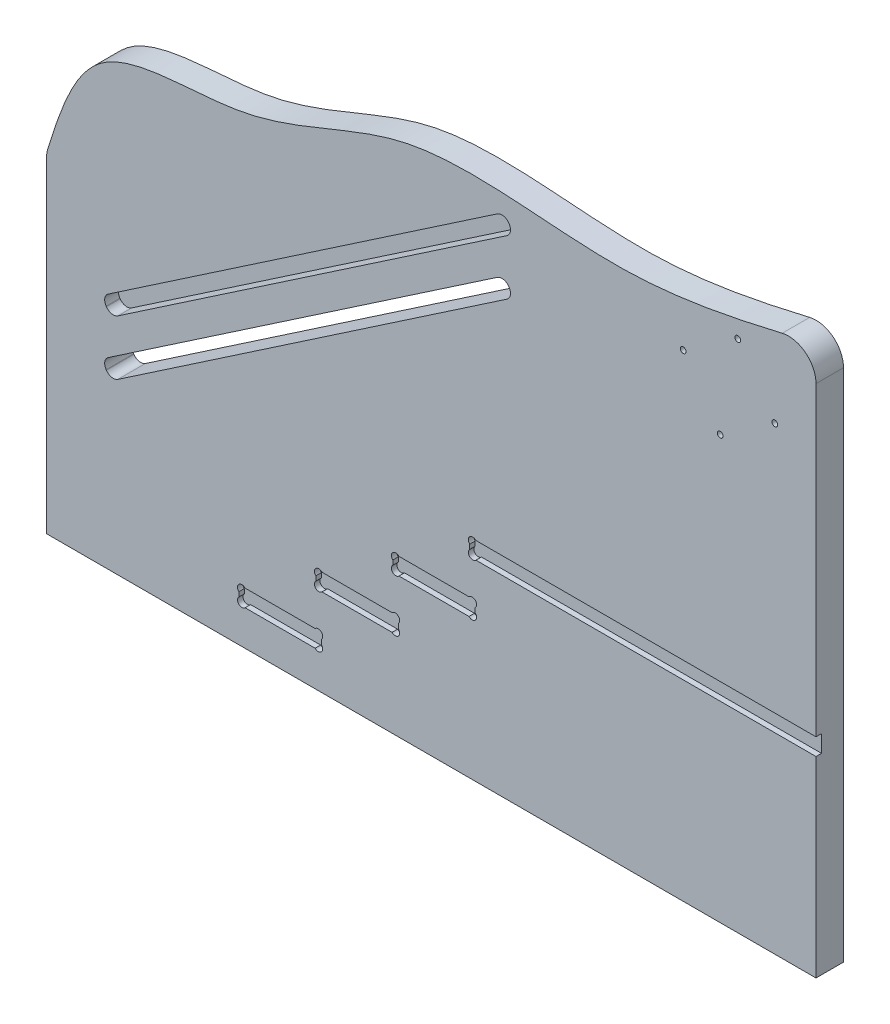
ISO-10303-21;
HEADER;
FILE_DESCRIPTION(('STEP AP214'),'2;1');
FILE_NAME('part.step','',(''),(''),'','','');
FILE_SCHEMA(('AUTOMOTIVE_DESIGN { 1 0 10303 214 1 1 1 1 }'));
ENDSEC;
DATA;
#1=APPLICATION_CONTEXT('core data for automotive mechanical design processes');
#2=APPLICATION_PROTOCOL_DEFINITION('international standard','automotive_design',2000,#1);
#3=PRODUCT_CONTEXT('',#1,'mechanical');
#4=PRODUCT('Part','Part','',(#3));
#5=PRODUCT_RELATED_PRODUCT_CATEGORY('part','',(#4));
#6=PRODUCT_DEFINITION_FORMATION('','',#4);
#7=PRODUCT_DEFINITION_CONTEXT('part definition',#1,'design');
#8=PRODUCT_DEFINITION('design','',#6,#7);
#9=PRODUCT_DEFINITION_SHAPE('','',#8);
#10=(LENGTH_UNIT() NAMED_UNIT(*) SI_UNIT(.MILLI.,.METRE.));
#11=(NAMED_UNIT(*) PLANE_ANGLE_UNIT() SI_UNIT($,.RADIAN.));
#12=(NAMED_UNIT(*) SI_UNIT($,.STERADIAN.) SOLID_ANGLE_UNIT());
#13=UNCERTAINTY_MEASURE_WITH_UNIT(LENGTH_MEASURE(1.E-05),#10,'distance_accuracy_value','');
#14=(GEOMETRIC_REPRESENTATION_CONTEXT(3) GLOBAL_UNCERTAINTY_ASSIGNED_CONTEXT((#13)) GLOBAL_UNIT_ASSIGNED_CONTEXT((#10,
#11,#12)) REPRESENTATION_CONTEXT('',''));
#15=CARTESIAN_POINT('',(0.,0.,0.));
#16=DIRECTION('',(0.,0.,1.));
#17=DIRECTION('',(1.,0.,0.));
#18=AXIS2_PLACEMENT_3D('',#15,#16,#17);
#19=CARTESIAN_POINT('',(200.,151.678648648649,10.));
#20=CARTESIAN_POINT('',(176.932927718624,146.058814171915,10.));
#21=CARTESIAN_POINT('',(127.862897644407,134.103874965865,10.));
#22=CARTESIAN_POINT('',(53.1066496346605,150.407436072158,10.));
#23=CARTESIAN_POINT('',(-2.76456005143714,114.401511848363,10.));
#24=CARTESIAN_POINT('',(-64.742723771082,120.604717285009,10.));
#25=CARTESIAN_POINT('',(-75.2015204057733,87.0661095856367,10.));
#26=CARTESIAN_POINT('',(-80.,71.6786486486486,10.));
#27=B_SPLINE_CURVE_WITH_KNOTS('',3,(#19,#20,#21,#22,#23,#24,#25,#26),.UNSPECIFIED.,.F.,.F.,(4,1,
1,1,1,4),(0.,0.230093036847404,0.489471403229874,0.694528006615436,0.85984992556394,1.),.UNSPECIFIED.);
#28=DIRECTION('',(0.,0.,-1.));
#29=VECTOR('',#28,1.);
#30=SURFACE_OF_LINEAR_EXTRUSION('',#27,#29);
#31=CARTESIAN_POINT('',(200.,151.678648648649,0.));
#32=CARTESIAN_POINT('',(176.932927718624,146.058814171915,0.));
#33=CARTESIAN_POINT('',(127.862897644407,134.103874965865,0.));
#34=CARTESIAN_POINT('',(53.1066496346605,150.407436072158,0.));
#35=CARTESIAN_POINT('',(-2.76456005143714,114.401511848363,0.));
#36=CARTESIAN_POINT('',(-64.742723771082,120.604717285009,0.));
#37=CARTESIAN_POINT('',(-75.2015204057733,87.0661095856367,0.));
#38=CARTESIAN_POINT('',(-80.,71.6786486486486,0.));
#39=B_SPLINE_CURVE_WITH_KNOTS('',3,(#31,#32,#33,#34,#35,#36,#37,#38),.UNSPECIFIED.,.F.,.F.,(4,1,
1,1,1,4),(0.,0.230093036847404,0.489471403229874,0.694528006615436,0.85984992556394,1.),.UNSPECIFIED.);
#40=CARTESIAN_POINT('',(187.700498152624,148.712267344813,0.));
#41=VERTEX_POINT('',#40);
#42=CARTESIAN_POINT('',(-79.5451649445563,73.1363716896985,0.));
#43=VERTEX_POINT('',#42);
#44=EDGE_CURVE('E456',#41,#43,#39,.T.);
#45=ORIENTED_EDGE('',*,*,#44,.T.);
#46=DIRECTION('',(0.,0.,-1.));
#47=VECTOR('',#46,1.);
#48=CARTESIAN_POINT('',(-79.5451649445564,73.1363716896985,0.));
#49=LINE('',#48,#47);
#50=CARTESIAN_POINT('',(-79.5451649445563,73.1363716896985,10.));
#51=VERTEX_POINT('',#50);
#52=EDGE_CURVE('E503',#43,#51,#49,.F.);
#53=ORIENTED_EDGE('',*,*,#52,.T.);
#54=CARTESIAN_POINT('',(187.700498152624,148.712267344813,10.));
#55=VERTEX_POINT('',#54);
#56=EDGE_CURVE('E470',#55,#51,#27,.T.);
#57=ORIENTED_EDGE('',*,*,#56,.F.);
#58=DIRECTION('',(0.,0.,-1.));
#59=VECTOR('',#58,1.);
#60=CARTESIAN_POINT('',(187.700498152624,148.712267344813,10.));
#61=LINE('',#60,#59);
#62=EDGE_CURVE('E500',#55,#41,#61,.T.);
#63=ORIENTED_EDGE('',*,*,#62,.T.);
#64=EDGE_LOOP('',(#45,#53,#57,#63));
#65=FACE_BOUND('',#64,.T.);
#66=ADVANCED_FACE('F27',(#65),#30,.F.);
#67=CARTESIAN_POINT('',(-80.,71.6786486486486,10.));
#68=DIRECTION('',(1.,0.,0.));
#69=DIRECTION('',(0.,0.,-1.));
#70=AXIS2_PLACEMENT_3D('',#67,#68,#69);
#71=PLANE('',#70);
#72=DIRECTION('',(0.,-1.,0.));
#73=VECTOR('',#72,1.);
#74=CARTESIAN_POINT('',(-80.,71.6786486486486,10.));
#75=LINE('',#74,#73);
#76=CARTESIAN_POINT('',(-80.,70.154790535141,10.));
#77=VERTEX_POINT('',#76);
#78=CARTESIAN_POINT('',(-80.,-48.3213513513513,10.));
#79=VERTEX_POINT('',#78);
#80=EDGE_CURVE('E476',#77,#79,#75,.T.);
#81=ORIENTED_EDGE('',*,*,#80,.F.);
#82=DIRECTION('',(0.,0.,-1.));
#83=VECTOR('',#82,1.);
#84=CARTESIAN_POINT('',(-80.,70.154790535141,10.));
#85=LINE('',#84,#83);
#86=CARTESIAN_POINT('',(-80.,70.154790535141,0.));
#87=VERTEX_POINT('',#86);
#88=EDGE_CURVE('E493',#77,#87,#85,.T.);
#89=ORIENTED_EDGE('',*,*,#88,.T.);
#90=DIRECTION('',(0.,-1.,0.));
#91=VECTOR('',#90,1.);
#92=CARTESIAN_POINT('',(-80.,71.6786486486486,0.));
#93=LINE('',#92,#91);
#94=CARTESIAN_POINT('',(-80.,-48.3213513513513,0.));
#95=VERTEX_POINT('',#94);
#96=EDGE_CURVE('E461',#87,#95,#93,.T.);
#97=ORIENTED_EDGE('',*,*,#96,.T.);
#98=DIRECTION('',(0.,0.,-1.));
#99=VECTOR('',#98,1.);
#100=CARTESIAN_POINT('',(-80.,-48.3213513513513,10.));
#101=LINE('',#100,#99);
#102=EDGE_CURVE('E490',#79,#95,#101,.T.);
#103=ORIENTED_EDGE('',*,*,#102,.F.);
#104=EDGE_LOOP('',(#81,#89,#97,#103));
#105=FACE_BOUND('',#104,.T.);
#106=ADVANCED_FACE('F858',(#105),#71,.F.);
#107=CARTESIAN_POINT('',(-80.,-48.3213513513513,10.));
#108=DIRECTION('',(0.,1.,0.));
#109=DIRECTION('',(0.,0.,1.));
#110=AXIS2_PLACEMENT_3D('',#107,#108,#109);
#111=PLANE('',#110);
#112=DIRECTION('',(1.,0.,0.));
#113=VECTOR('',#112,1.);
#114=CARTESIAN_POINT('',(-80.,-48.3213513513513,0.));
#115=LINE('',#114,#113);
#116=CARTESIAN_POINT('',(200.,-48.3213513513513,0.));
#117=VERTEX_POINT('',#116);
#118=EDGE_CURVE('E466',#95,#117,#115,.T.);
#119=ORIENTED_EDGE('',*,*,#118,.T.);
#120=DIRECTION('',(0.,0.,-1.));
#121=VECTOR('',#120,1.);
#122=CARTESIAN_POINT('',(200.,-48.3213513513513,10.));
#123=LINE('',#122,#121);
#124=CARTESIAN_POINT('',(200.,-48.3213513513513,10.));
#125=VERTEX_POINT('',#124);
#126=EDGE_CURVE('E487',#125,#117,#123,.T.);
#127=ORIENTED_EDGE('',*,*,#126,.F.);
#128=DIRECTION('',(1.,0.,0.));
#129=VECTOR('',#128,1.);
#130=CARTESIAN_POINT('',(-80.,-48.3213513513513,10.));
#131=LINE('',#130,#129);
#132=EDGE_CURVE('E481',#79,#125,#131,.T.);
#133=ORIENTED_EDGE('',*,*,#132,.F.);
#134=ORIENTED_EDGE('',*,*,#102,.T.);
#135=EDGE_LOOP('',(#119,#127,#133,#134));
#136=FACE_BOUND('',#135,.T.);
#137=ADVANCED_FACE('F864',(#136),#111,.F.);
#138=CARTESIAN_POINT('',(200.,-48.3213513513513,10.));
#139=DIRECTION('',(-1.,0.,0.));
#140=DIRECTION('',(0.,0.,1.));
#141=AXIS2_PLACEMENT_3D('',#138,#139,#140);
#142=PLANE('',#141);
#143=DIRECTION('',(0.,1.,0.));
#144=VECTOR('',#143,1.);
#145=CARTESIAN_POINT('',(200.,21.4786486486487,8.));
#146=LINE('',#145,#144);
#147=CARTESIAN_POINT('',(200.,21.4786486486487,8.));
#148=VERTEX_POINT('',#147);
#149=CARTESIAN_POINT('',(200.,27.6786486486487,8.));
#150=VERTEX_POINT('',#149);
#151=EDGE_CURVE('E386',#148,#150,#146,.T.);
#152=ORIENTED_EDGE('',*,*,#151,.F.);
#153=DIRECTION('',(0.,0.,1.));
#154=VECTOR('',#153,1.);
#155=CARTESIAN_POINT('',(200.,21.4786486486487,8.));
#156=LINE('',#155,#154);
#157=CARTESIAN_POINT('',(200.,21.4786486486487,10.));
#158=VERTEX_POINT('',#157);
#159=EDGE_CURVE('E390',#148,#158,#156,.T.);
#160=ORIENTED_EDGE('',*,*,#159,.T.);
#161=DIRECTION('',(0.,1.,0.));
#162=VECTOR('',#161,1.);
#163=CARTESIAN_POINT('',(200.,-48.3213513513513,10.));
#164=LINE('',#163,#162);
#165=EDGE_CURVE('E484',#125,#158,#164,.T.);
#166=ORIENTED_EDGE('',*,*,#165,.F.);
#167=ORIENTED_EDGE('',*,*,#126,.T.);
#168=DIRECTION('',(0.,1.,0.));
#169=VECTOR('',#168,1.);
#170=CARTESIAN_POINT('',(200.,-48.3213513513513,0.));
#171=LINE('',#170,#169);
#172=CARTESIAN_POINT('',(200.,138.980243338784,0.));
#173=VERTEX_POINT('',#172);
#174=EDGE_CURVE('E468',#117,#173,#171,.T.);
#175=ORIENTED_EDGE('',*,*,#174,.T.);
#176=DIRECTION('',(0.,0.,-1.));
#177=VECTOR('',#176,1.);
#178=CARTESIAN_POINT('',(200.,138.980243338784,10.));
#179=LINE('',#178,#177);
#180=CARTESIAN_POINT('',(200.,138.980243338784,10.));
#181=VERTEX_POINT('',#180);
#182=EDGE_CURVE('E509',#173,#181,#179,.F.);
#183=ORIENTED_EDGE('',*,*,#182,.T.);
#184=CARTESIAN_POINT('',(200.,27.6786486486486,10.));
#185=VERTEX_POINT('',#184);
#186=EDGE_CURVE('E483',#185,#181,#164,.T.);
#187=ORIENTED_EDGE('',*,*,#186,.F.);
#188=DIRECTION('',(0.,0.,1.));
#189=VECTOR('',#188,1.);
#190=CARTESIAN_POINT('',(200.,27.6786486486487,8.));
#191=LINE('',#190,#189);
#192=EDGE_CURVE('E384',#150,#185,#191,.T.);
#193=ORIENTED_EDGE('',*,*,#192,.F.);
#194=EDGE_LOOP('',(#152,#160,#166,#167,#175,#183,#187,#193));
#195=FACE_BOUND('',#194,.T.);
#196=ADVANCED_FACE('F631',(#195),#142,.F.);
#197=CARTESIAN_POINT('',(46.9467455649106,139.263112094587,10.));
#198=DIRECTION('',(0.,0.,1.));
#199=DIRECTION('',(1.,0.,0.));
#200=AXIS2_PLACEMENT_3D('',#197,#198,#199);
#201=PLANE('',#200);
#202=CARTESIAN_POINT('',(75.1,22.5786486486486,10.));
#203=DIRECTION('',(0.,0.,1.));
#204=DIRECTION('',(1.,0.,0.));
#205=AXIS2_PLACEMENT_3D('',#202,#203,#204);
#206=CIRCLE('',#205,1.6);
#207=CARTESIAN_POINT('',(74.,23.7405436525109,10.));
#208=VERTEX_POINT('',#207);
#209=CARTESIAN_POINT('',(76.2618950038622,21.4786486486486,10.));
#210=VERTEX_POINT('',#209);
#211=EDGE_CURVE('E366',#208,#210,#206,.T.);
#212=ORIENTED_EDGE('',*,*,#211,.F.);
#213=DIRECTION('',(0.,-1.,0.));
#214=VECTOR('',#213,1.);
#215=CARTESIAN_POINT('',(74.,21.4786486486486,10.));
#216=LINE('',#215,#214);
#217=CARTESIAN_POINT('',(74.,25.4167536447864,10.));
#218=VERTEX_POINT('',#217);
#219=EDGE_CURVE('E375',#218,#208,#216,.T.);
#220=ORIENTED_EDGE('',*,*,#219,.F.);
#221=CARTESIAN_POINT('',(75.1,26.5786486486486,10.));
#222=DIRECTION('',(0.,0.,1.));
#223=DIRECTION('',(1.,0.,0.));
#224=AXIS2_PLACEMENT_3D('',#221,#222,#223);
#225=CIRCLE('',#224,1.6);
#226=CARTESIAN_POINT('',(76.2618950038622,27.6786486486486,10.));
#227=VERTEX_POINT('',#226);
#228=EDGE_CURVE('E639',#227,#218,#225,.T.);
#229=ORIENTED_EDGE('',*,*,#228,.F.);
#230=DIRECTION('',(-1.,0.,0.));
#231=VECTOR('',#230,1.);
#232=CARTESIAN_POINT('',(200.,27.6786486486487,10.));
#233=LINE('',#232,#231);
#234=EDGE_CURVE('E620',#185,#227,#233,.T.);
#235=ORIENTED_EDGE('',*,*,#234,.F.);
#236=ORIENTED_EDGE('',*,*,#186,.T.);
#237=CARTESIAN_POINT('',(190.,138.980243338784,10.));
#238=DIRECTION('',(0.,0.,1.));
#239=DIRECTION('',(1.,0.,0.));
#240=AXIS2_PLACEMENT_3D('',#237,#238,#239);
#241=CIRCLE('',#240,10.);
#242=EDGE_CURVE('E505',#181,#55,#241,.T.);
#243=ORIENTED_EDGE('',*,*,#242,.T.);
#244=ORIENTED_EDGE('',*,*,#56,.T.);
#245=CARTESIAN_POINT('',(-70.,70.154790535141,10.));
#246=DIRECTION('',(0.,0.,1.));
#247=DIRECTION('',(1.,0.,0.));
#248=AXIS2_PLACEMENT_3D('',#245,#246,#247);
#249=CIRCLE('',#248,10.);
#250=EDGE_CURVE('E507',#51,#77,#249,.T.);
#251=ORIENTED_EDGE('',*,*,#250,.T.);
#252=ORIENTED_EDGE('',*,*,#80,.T.);
#253=ORIENTED_EDGE('',*,*,#132,.T.);
#254=ORIENTED_EDGE('',*,*,#165,.T.);
#255=DIRECTION('',(1.,0.,0.));
#256=VECTOR('',#255,1.);
#257=CARTESIAN_POINT('',(200.,21.4786486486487,10.));
#258=LINE('',#257,#256);
#259=EDGE_CURVE('E624',#210,#158,#258,.T.);
#260=ORIENTED_EDGE('',*,*,#259,.F.);
#261=EDGE_LOOP('',(#212,#220,#229,#235,#236,#243,#244,#251,#252,#253,#254,#260));
#262=FACE_BOUND('',#261,.T.);
#263=CARTESIAN_POINT('',(74.9,7.57864864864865,10.));
#264=DIRECTION('',(0.,0.,1.));
#265=DIRECTION('',(-1.,0.,0.));
#266=AXIS2_PLACEMENT_3D('',#263,#264,#265);
#267=CIRCLE('',#266,1.59999999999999);
#268=CARTESIAN_POINT('',(76.,6.41675364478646,10.));
#269=VERTEX_POINT('',#268);
#270=CARTESIAN_POINT('',(73.7381049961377,8.67864864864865,10.));
#271=VERTEX_POINT('',#270);
#272=EDGE_CURVE('E649',#269,#271,#267,.T.);
#273=ORIENTED_EDGE('',*,*,#272,.F.);
#274=DIRECTION('',(0.,1.,0.));
#275=VECTOR('',#274,1.);
#276=CARTESIAN_POINT('',(76.,8.67864864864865,10.));
#277=LINE('',#276,#275);
#278=CARTESIAN_POINT('',(76.,4.74054365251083,10.));
#279=VERTEX_POINT('',#278);
#280=EDGE_CURVE('E400',#279,#269,#277,.T.);
#281=ORIENTED_EDGE('',*,*,#280,.F.);
#282=CARTESIAN_POINT('',(74.9,3.57864864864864,10.));
#283=DIRECTION('',(0.,0.,1.));
#284=DIRECTION('',(-1.,0.,0.));
#285=AXIS2_PLACEMENT_3D('',#282,#283,#284);
#286=CIRCLE('',#285,1.59999999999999);
#287=CARTESIAN_POINT('',(73.7381049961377,2.47864864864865,10.));
#288=VERTEX_POINT('',#287);
#289=EDGE_CURVE('E660',#288,#279,#286,.T.);
#290=ORIENTED_EDGE('',*,*,#289,.F.);
#291=DIRECTION('',(1.,0.,0.));
#292=VECTOR('',#291,1.);
#293=CARTESIAN_POINT('',(46.,2.47864864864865,10.));
#294=LINE('',#293,#292);
#295=CARTESIAN_POINT('',(48.2618950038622,2.47864864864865,10.));
#296=VERTEX_POINT('',#295);
#297=EDGE_CURVE('E397',#296,#288,#294,.T.);
#298=ORIENTED_EDGE('',*,*,#297,.F.);
#299=CARTESIAN_POINT('',(47.1,3.57864864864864,10.));
#300=DIRECTION('',(0.,0.,1.));
#301=DIRECTION('',(1.,0.,0.));
#302=AXIS2_PLACEMENT_3D('',#299,#300,#301);
#303=CIRCLE('',#302,1.6);
#304=CARTESIAN_POINT('',(46.,4.74054365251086,10.));
#305=VERTEX_POINT('',#304);
#306=EDGE_CURVE('E671',#305,#296,#303,.T.);
#307=ORIENTED_EDGE('',*,*,#306,.F.);
#308=DIRECTION('',(0.,-1.,0.));
#309=VECTOR('',#308,1.);
#310=CARTESIAN_POINT('',(46.,8.67864864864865,10.));
#311=LINE('',#310,#309);
#312=CARTESIAN_POINT('',(46.,6.41675364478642,10.));
#313=VERTEX_POINT('',#312);
#314=EDGE_CURVE('E393',#313,#305,#311,.T.);
#315=ORIENTED_EDGE('',*,*,#314,.F.);
#316=CARTESIAN_POINT('',(47.1,7.57864864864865,10.));
#317=DIRECTION('',(0.,0.,1.));
#318=DIRECTION('',(1.,0.,0.));
#319=AXIS2_PLACEMENT_3D('',#316,#317,#318);
#320=CIRCLE('',#319,1.6);
#321=CARTESIAN_POINT('',(48.2618950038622,8.67864864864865,10.));
#322=VERTEX_POINT('',#321);
#323=EDGE_CURVE('E680',#322,#313,#320,.T.);
#324=ORIENTED_EDGE('',*,*,#323,.F.);
#325=DIRECTION('',(-1.,0.,0.));
#326=VECTOR('',#325,1.);
#327=CARTESIAN_POINT('',(46.,8.67864864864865,10.));
#328=LINE('',#327,#326);
#329=EDGE_CURVE('E403',#271,#322,#328,.T.);
#330=ORIENTED_EDGE('',*,*,#329,.F.);
#331=EDGE_LOOP('',(#273,#281,#290,#298,#307,#315,#324,#330));
#332=FACE_BOUND('',#331,.T.);
#333=CARTESIAN_POINT('',(46.9,-11.4213513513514,10.));
#334=DIRECTION('',(0.,0.,1.));
#335=DIRECTION('',(-1.,0.,0.));
#336=AXIS2_PLACEMENT_3D('',#333,#334,#335);
#337=CIRCLE('',#336,1.6);
#338=CARTESIAN_POINT('',(48.,-12.5832463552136,10.));
#339=VERTEX_POINT('',#338);
#340=CARTESIAN_POINT('',(45.7381049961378,-10.3213513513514,10.));
#341=VERTEX_POINT('',#340);
#342=EDGE_CURVE('E691',#339,#341,#337,.T.);
#343=ORIENTED_EDGE('',*,*,#342,.F.);
#344=DIRECTION('',(0.,1.,0.));
#345=VECTOR('',#344,1.);
#346=CARTESIAN_POINT('',(48.,-10.3213513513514,10.));
#347=LINE('',#346,#345);
#348=CARTESIAN_POINT('',(48.,-14.2594563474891,10.));
#349=VERTEX_POINT('',#348);
#350=EDGE_CURVE('E420',#349,#339,#347,.T.);
#351=ORIENTED_EDGE('',*,*,#350,.F.);
#352=CARTESIAN_POINT('',(46.9,-15.4213513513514,10.));
#353=DIRECTION('',(0.,0.,1.));
#354=DIRECTION('',(-1.,0.,0.));
#355=AXIS2_PLACEMENT_3D('',#352,#353,#354);
#356=CIRCLE('',#355,1.6);
#357=CARTESIAN_POINT('',(45.7381049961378,-16.5213513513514,10.));
#358=VERTEX_POINT('',#357);
#359=EDGE_CURVE('E702',#358,#349,#356,.T.);
#360=ORIENTED_EDGE('',*,*,#359,.F.);
#361=DIRECTION('',(1.,0.,0.));
#362=VECTOR('',#361,1.);
#363=CARTESIAN_POINT('',(18.,-16.5213513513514,10.));
#364=LINE('',#363,#362);
#365=CARTESIAN_POINT('',(20.2618950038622,-16.5213513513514,10.));
#366=VERTEX_POINT('',#365);
#367=EDGE_CURVE('E417',#366,#358,#364,.T.);
#368=ORIENTED_EDGE('',*,*,#367,.F.);
#369=CARTESIAN_POINT('',(19.1,-15.4213513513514,10.));
#370=DIRECTION('',(0.,0.,1.));
#371=DIRECTION('',(1.,0.,0.));
#372=AXIS2_PLACEMENT_3D('',#369,#370,#371);
#373=CIRCLE('',#372,1.6);
#374=CARTESIAN_POINT('',(18.,-14.2594563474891,10.));
#375=VERTEX_POINT('',#374);
#376=EDGE_CURVE('E713',#375,#366,#373,.T.);
#377=ORIENTED_EDGE('',*,*,#376,.F.);
#378=DIRECTION('',(0.,-1.,0.));
#379=VECTOR('',#378,1.);
#380=CARTESIAN_POINT('',(18.,-10.3213513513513,10.));
#381=LINE('',#380,#379);
#382=CARTESIAN_POINT('',(18.,-12.5832463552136,10.));
#383=VERTEX_POINT('',#382);
#384=EDGE_CURVE('E414',#383,#375,#381,.T.);
#385=ORIENTED_EDGE('',*,*,#384,.F.);
#386=CARTESIAN_POINT('',(19.1,-11.4213513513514,10.));
#387=DIRECTION('',(0.,0.,1.));
#388=DIRECTION('',(1.,0.,0.));
#389=AXIS2_PLACEMENT_3D('',#386,#387,#388);
#390=CIRCLE('',#389,1.6);
#391=CARTESIAN_POINT('',(20.2618950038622,-10.3213513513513,10.));
#392=VERTEX_POINT('',#391);
#393=EDGE_CURVE('E722',#392,#383,#390,.T.);
#394=ORIENTED_EDGE('',*,*,#393,.F.);
#395=DIRECTION('',(-1.,0.,0.));
#396=VECTOR('',#395,1.);
#397=CARTESIAN_POINT('',(18.,-10.3213513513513,10.));
#398=LINE('',#397,#396);
#399=EDGE_CURVE('E423',#341,#392,#398,.T.);
#400=ORIENTED_EDGE('',*,*,#399,.F.);
#401=EDGE_LOOP('',(#343,#351,#360,#368,#377,#385,#394,#400));
#402=FACE_BOUND('',#401,.T.);
#403=CARTESIAN_POINT('',(18.9,-30.4213513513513,10.));
#404=DIRECTION('',(0.,0.,1.));
#405=DIRECTION('',(-1.,0.,0.));
#406=AXIS2_PLACEMENT_3D('',#403,#404,#405);
#407=CIRCLE('',#406,1.59999999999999);
#408=CARTESIAN_POINT('',(20.,-31.5832463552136,10.));
#409=VERTEX_POINT('',#408);
#410=CARTESIAN_POINT('',(17.7381049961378,-29.3213513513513,10.));
#411=VERTEX_POINT('',#410);
#412=EDGE_CURVE('E733',#409,#411,#407,.T.);
#413=ORIENTED_EDGE('',*,*,#412,.F.);
#414=DIRECTION('',(0.,1.,0.));
#415=VECTOR('',#414,1.);
#416=CARTESIAN_POINT('',(20.,-29.3213513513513,10.));
#417=LINE('',#416,#415);
#418=CARTESIAN_POINT('',(20.,-33.2594563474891,10.));
#419=VERTEX_POINT('',#418);
#420=EDGE_CURVE('E440',#419,#409,#417,.T.);
#421=ORIENTED_EDGE('',*,*,#420,.F.);
#422=CARTESIAN_POINT('',(18.9,-34.4213513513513,10.));
#423=DIRECTION('',(0.,0.,1.));
#424=DIRECTION('',(-1.,0.,0.));
#425=AXIS2_PLACEMENT_3D('',#422,#423,#424);
#426=CIRCLE('',#425,1.6);
#427=CARTESIAN_POINT('',(17.7381049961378,-35.5213513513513,10.));
#428=VERTEX_POINT('',#427);
#429=EDGE_CURVE('E744',#428,#419,#426,.T.);
#430=ORIENTED_EDGE('',*,*,#429,.F.);
#431=DIRECTION('',(1.,0.,0.));
#432=VECTOR('',#431,1.);
#433=CARTESIAN_POINT('',(-10.,-35.5213513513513,10.));
#434=LINE('',#433,#432);
#435=CARTESIAN_POINT('',(-7.73810499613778,-35.5213513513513,10.));
#436=VERTEX_POINT('',#435);
#437=EDGE_CURVE('E437',#436,#428,#434,.T.);
#438=ORIENTED_EDGE('',*,*,#437,.F.);
#439=CARTESIAN_POINT('',(-8.9,-34.4213513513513,10.));
#440=DIRECTION('',(0.,0.,1.));
#441=DIRECTION('',(1.,0.,0.));
#442=AXIS2_PLACEMENT_3D('',#439,#440,#441);
#443=CIRCLE('',#442,1.6);
#444=CARTESIAN_POINT('',(-10.,-33.2594563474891,10.));
#445=VERTEX_POINT('',#444);
#446=EDGE_CURVE('E755',#445,#436,#443,.T.);
#447=ORIENTED_EDGE('',*,*,#446,.F.);
#448=DIRECTION('',(0.,-1.,0.));
#449=VECTOR('',#448,1.);
#450=CARTESIAN_POINT('',(-10.,-29.3213513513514,10.));
#451=LINE('',#450,#449);
#452=CARTESIAN_POINT('',(-10.,-31.5832463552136,10.));
#453=VERTEX_POINT('',#452);
#454=EDGE_CURVE('E434',#453,#445,#451,.T.);
#455=ORIENTED_EDGE('',*,*,#454,.F.);
#456=CARTESIAN_POINT('',(-8.9,-30.4213513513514,10.));
#457=DIRECTION('',(0.,0.,1.));
#458=DIRECTION('',(1.,0.,0.));
#459=AXIS2_PLACEMENT_3D('',#456,#457,#458);
#460=CIRCLE('',#459,1.6);
#461=CARTESIAN_POINT('',(-7.73810499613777,-29.3213513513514,10.));
#462=VERTEX_POINT('',#461);
#463=EDGE_CURVE('E765',#462,#453,#460,.T.);
#464=ORIENTED_EDGE('',*,*,#463,.F.);
#465=DIRECTION('',(-1.,0.,0.));
#466=VECTOR('',#465,1.);
#467=CARTESIAN_POINT('',(-10.,-29.3213513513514,10.));
#468=LINE('',#467,#466);
#469=EDGE_CURVE('E443',#411,#462,#468,.T.);
#470=ORIENTED_EDGE('',*,*,#469,.F.);
#471=EDGE_LOOP('',(#413,#421,#430,#438,#447,#455,#464,#470));
#472=FACE_BOUND('',#471,.T.);
#473=CARTESIAN_POINT('',(185.,118.980243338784,10.));
#474=DIRECTION('',(0.,0.,1.));
#475=DIRECTION('',(1.,0.,0.));
#476=AXIS2_PLACEMENT_3D('',#473,#474,#475);
#477=CIRCLE('',#476,1.04999999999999);
#478=CARTESIAN_POINT('',(186.05,118.980243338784,10.));
#479=VERTEX_POINT('',#478);
#480=EDGE_CURVE('E776',#479,#479,#477,.T.);
#481=ORIENTED_EDGE('',*,*,#480,.F.);
#482=EDGE_LOOP('',(#481));
#483=FACE_BOUND('',#482,.T.);
#484=CARTESIAN_POINT('',(165.140653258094,105.504103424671,10.));
#485=DIRECTION('',(0.,0.,1.));
#486=DIRECTION('',(1.,0.,0.));
#487=AXIS2_PLACEMENT_3D('',#484,#485,#486);
#488=CIRCLE('',#487,1.04999999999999);
#489=CARTESIAN_POINT('',(166.190653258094,105.504103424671,10.));
#490=VERTEX_POINT('',#489);
#491=EDGE_CURVE('E782',#490,#490,#488,.T.);
#492=ORIENTED_EDGE('',*,*,#491,.F.);
#493=EDGE_LOOP('',(#492));
#494=FACE_BOUND('',#493,.T.);
#495=CARTESIAN_POINT('',(171.523860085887,138.83959008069,10.));
#496=DIRECTION('',(0.,0.,1.));
#497=DIRECTION('',(1.,0.,0.));
#498=AXIS2_PLACEMENT_3D('',#495,#496,#497);
#499=CIRCLE('',#498,1.04999999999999);
#500=CARTESIAN_POINT('',(172.573860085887,138.83959008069,10.));
#501=VERTEX_POINT('',#500);
#502=EDGE_CURVE('E788',#501,#501,#499,.T.);
#503=ORIENTED_EDGE('',*,*,#502,.F.);
#504=EDGE_LOOP('',(#503));
#505=FACE_BOUND('',#504,.T.);
#506=CARTESIAN_POINT('',(151.664513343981,125.363450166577,10.));
#507=DIRECTION('',(0.,0.,1.));
#508=DIRECTION('',(1.,0.,0.));
#509=AXIS2_PLACEMENT_3D('',#506,#507,#508);
#510=CIRCLE('',#509,1.04999999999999);
#511=CARTESIAN_POINT('',(152.714513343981,125.363450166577,10.));
#512=VERTEX_POINT('',#511);
#513=EDGE_CURVE('E794',#512,#512,#510,.T.);
#514=ORIENTED_EDGE('',*,*,#513,.F.);
#515=EDGE_LOOP('',(#514));
#516=FACE_BOUND('',#515,.T.);
#517=DIRECTION('',(0.561501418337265,-0.827475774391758,0.));
#518=VECTOR('',#517,1.);
#519=CARTESIAN_POINT('',(-60.,36.7650898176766,10.));
#520=LINE('',#519,#518);
#521=CARTESIAN_POINT('',(-58.3154957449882,34.2826624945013,10.));
#522=VERTEX_POINT('',#521);
#523=CARTESIAN_POINT('',(-58.2031954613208,34.117167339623,10.));
#524=VERTEX_POINT('',#523);
#525=EDGE_CURVE('E800',#522,#524,#520,.T.);
#526=ORIENTED_EDGE('',*,*,#525,.F.);
#527=CARTESIAN_POINT('',(-55.8330684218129,35.9671667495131,10.));
#528=DIRECTION('',(0.,0.,1.));
#529=DIRECTION('',(1.,0.,0.));
#530=AXIS2_PLACEMENT_3D('',#527,#528,#529);
#531=CIRCLE('',#530,3.);
#532=CARTESIAN_POINT('',(-57.5175726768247,38.4495940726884,10.));
#533=VERTEX_POINT('',#532);
#534=EDGE_CURVE('E564',#522,#533,#531,.F.);
#535=ORIENTED_EDGE('',*,*,#534,.T.);
#536=DIRECTION('',(-0.827475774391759,-0.561501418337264,0.));
#537=VECTOR('',#536,1.);
#538=CARTESIAN_POINT('',(86.518691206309,136.188487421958,10.));
#539=LINE('',#538,#537);
#540=CARTESIAN_POINT('',(84.0362638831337,134.503983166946,10.));
#541=VERTEX_POINT('',#540);
#542=EDGE_CURVE('E809',#541,#533,#539,.T.);
#543=ORIENTED_EDGE('',*,*,#542,.F.);
#544=CARTESIAN_POINT('',(85.7207681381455,132.021555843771,10.));
#545=DIRECTION('',(0.,0.,1.));
#546=DIRECTION('',(1.,0.,0.));
#547=AXIS2_PLACEMENT_3D('',#544,#545,#546);
#548=CIRCLE('',#547,3.);
#549=CARTESIAN_POINT('',(88.2031954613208,133.706060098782,10.));
#550=VERTEX_POINT('',#549);
#551=EDGE_CURVE('E562',#541,#550,#548,.F.);
#552=ORIENTED_EDGE('',*,*,#551,.T.);
#553=DIRECTION('',(-0.561501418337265,0.827475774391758,0.));
#554=VECTOR('',#553,1.);
#555=CARTESIAN_POINT('',(90.,131.058137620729,10.));
#556=LINE('',#555,#554);
#557=CARTESIAN_POINT('',(88.3154957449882,133.540564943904,10.));
#558=VERTEX_POINT('',#557);
#559=EDGE_CURVE('E806',#558,#550,#556,.T.);
#560=ORIENTED_EDGE('',*,*,#559,.F.);
#561=CARTESIAN_POINT('',(85.8330684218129,131.856060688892,10.));
#562=DIRECTION('',(0.,0.,1.));
#563=DIRECTION('',(1.,0.,0.));
#564=AXIS2_PLACEMENT_3D('',#561,#562,#563);
#565=CIRCLE('',#564,3.);
#566=CARTESIAN_POINT('',(87.5175726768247,129.373633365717,10.));
#567=VERTEX_POINT('',#566);
#568=EDGE_CURVE('E560',#558,#567,#565,.F.);
#569=ORIENTED_EDGE('',*,*,#568,.T.);
#570=DIRECTION('',(0.827475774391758,0.561501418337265,0.));
#571=VECTOR('',#570,1.);
#572=CARTESIAN_POINT('',(-56.518691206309,31.6347400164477,10.));
#573=LINE('',#572,#571);
#574=CARTESIAN_POINT('',(-54.0362638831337,33.3192442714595,10.));
#575=VERTEX_POINT('',#574);
#576=EDGE_CURVE('E803',#575,#567,#573,.T.);
#577=ORIENTED_EDGE('',*,*,#576,.F.);
#578=CARTESIAN_POINT('',(-55.7207681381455,35.8016715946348,10.));
#579=DIRECTION('',(0.,0.,1.));
#580=DIRECTION('',(1.,0.,0.));
#581=AXIS2_PLACEMENT_3D('',#578,#579,#580);
#582=CIRCLE('',#581,3.);
#583=EDGE_CURVE('E566',#575,#524,#582,.F.);
#584=ORIENTED_EDGE('',*,*,#583,.T.);
#585=EDGE_LOOP('',(#526,#535,#543,#552,#560,#569,#577,#584));
#586=FACE_BOUND('',#585,.T.);
#587=DIRECTION('',(0.561501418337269,-0.827475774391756,0.));
#588=VECTOR('',#587,1.);
#589=CARTESIAN_POINT('',(-56.518691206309,11.622069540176,10.));
#590=LINE('',#589,#588);
#591=CARTESIAN_POINT('',(-58.3154957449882,14.2699920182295,10.));
#592=VERTEX_POINT('',#591);
#593=CARTESIAN_POINT('',(-58.2031954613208,14.1044968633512,10.));
#594=VERTEX_POINT('',#593);
#595=EDGE_CURVE('E586',#592,#594,#590,.T.);
#596=ORIENTED_EDGE('',*,*,#595,.F.);
#597=CARTESIAN_POINT('',(-55.8330684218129,15.9544962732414,10.));
#598=DIRECTION('',(0.,0.,1.));
#599=DIRECTION('',(1.,0.,0.));
#600=AXIS2_PLACEMENT_3D('',#597,#598,#599);
#601=CIRCLE('',#600,3.);
#602=CARTESIAN_POINT('',(-57.5175726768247,18.4369235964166,10.));
#603=VERTEX_POINT('',#602);
#604=EDGE_CURVE('E35',#592,#603,#601,.F.);
#605=ORIENTED_EDGE('',*,*,#604,.T.);
#606=DIRECTION('',(-0.827475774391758,-0.561501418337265,0.));
#607=VECTOR('',#606,1.);
#608=CARTESIAN_POINT('',(-60.,16.7524193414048,10.));
#609=LINE('',#608,#607);
#610=CARTESIAN_POINT('',(84.0362638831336,114.491312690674,10.));
#611=VERTEX_POINT('',#610);
#612=EDGE_CURVE('E584',#611,#603,#609,.T.);
#613=ORIENTED_EDGE('',*,*,#612,.F.);
#614=CARTESIAN_POINT('',(85.7207681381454,112.008885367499,10.));
#615=DIRECTION('',(0.,0.,1.));
#616=DIRECTION('',(1.,0.,0.));
#617=AXIS2_PLACEMENT_3D('',#614,#615,#616);
#618=CIRCLE('',#617,3.);
#619=CARTESIAN_POINT('',(88.2031954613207,113.693389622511,10.));
#620=VERTEX_POINT('',#619);
#621=EDGE_CURVE('E568',#611,#620,#618,.F.);
#622=ORIENTED_EDGE('',*,*,#621,.T.);
#623=DIRECTION('',(-0.561501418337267,0.827475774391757,0.));
#624=VECTOR('',#623,1.);
#625=CARTESIAN_POINT('',(90.,111.045467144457,10.));
#626=LINE('',#625,#624);
#627=CARTESIAN_POINT('',(88.3154957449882,113.527894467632,10.));
#628=VERTEX_POINT('',#627);
#629=EDGE_CURVE('E596',#628,#620,#626,.T.);
#630=ORIENTED_EDGE('',*,*,#629,.F.);
#631=CARTESIAN_POINT('',(85.8330684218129,111.843390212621,10.));
#632=DIRECTION('',(0.,0.,1.));
#633=DIRECTION('',(1.,0.,0.));
#634=AXIS2_PLACEMENT_3D('',#631,#632,#633);
#635=CIRCLE('',#634,3.);
#636=CARTESIAN_POINT('',(87.5175726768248,109.360962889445,10.));
#637=VERTEX_POINT('',#636);
#638=EDGE_CURVE('E572',#628,#637,#635,.F.);
#639=ORIENTED_EDGE('',*,*,#638,.T.);
#640=DIRECTION('',(0.827475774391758,0.561501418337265,0.));
#641=VECTOR('',#640,1.);
#642=CARTESIAN_POINT('',(-56.518691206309,11.622069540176,10.));
#643=LINE('',#642,#641);
#644=CARTESIAN_POINT('',(-54.0362638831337,13.3065737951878,10.));
#645=VERTEX_POINT('',#644);
#646=EDGE_CURVE('E825',#645,#637,#643,.T.);
#647=ORIENTED_EDGE('',*,*,#646,.F.);
#648=CARTESIAN_POINT('',(-55.7207681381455,15.789001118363,10.));
#649=DIRECTION('',(0.,0.,1.));
#650=DIRECTION('',(1.,0.,0.));
#651=AXIS2_PLACEMENT_3D('',#648,#649,#650);
#652=CIRCLE('',#651,3.);
#653=EDGE_CURVE('E576',#645,#594,#652,.F.);
#654=ORIENTED_EDGE('',*,*,#653,.T.);
#655=EDGE_LOOP('',(#596,#605,#613,#622,#630,#639,#647,#654));
#656=FACE_BOUND('',#655,.T.);
#657=ADVANCED_FACE('F583',(#262,#332,#402,#472,#483,#494,#505,#516,#586,#656),#201,.T.);
#658=CARTESIAN_POINT('',(46.9467455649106,139.263112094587,0.));
#659=DIRECTION('',(0.,0.,1.));
#660=DIRECTION('',(1.,0.,0.));
#661=AXIS2_PLACEMENT_3D('',#658,#659,#660);
#662=PLANE('',#661);
#663=CARTESIAN_POINT('',(185.,118.980243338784,0.));
#664=DIRECTION('',(0.,0.,1.));
#665=DIRECTION('',(1.,0.,0.));
#666=AXIS2_PLACEMENT_3D('',#663,#664,#665);
#667=CIRCLE('',#666,1.04999999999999);
#668=CARTESIAN_POINT('',(186.05,118.980243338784,0.));
#669=VERTEX_POINT('',#668);
#670=EDGE_CURVE('E779',#669,#669,#667,.T.);
#671=ORIENTED_EDGE('',*,*,#670,.T.);
#672=EDGE_LOOP('',(#671));
#673=FACE_BOUND('',#672,.T.);
#674=CARTESIAN_POINT('',(165.140653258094,105.504103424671,0.));
#675=DIRECTION('',(0.,0.,1.));
#676=DIRECTION('',(1.,0.,0.));
#677=AXIS2_PLACEMENT_3D('',#674,#675,#676);
#678=CIRCLE('',#677,1.04999999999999);
#679=CARTESIAN_POINT('',(166.190653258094,105.504103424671,0.));
#680=VERTEX_POINT('',#679);
#681=EDGE_CURVE('E785',#680,#680,#678,.T.);
#682=ORIENTED_EDGE('',*,*,#681,.T.);
#683=EDGE_LOOP('',(#682));
#684=FACE_BOUND('',#683,.T.);
#685=CARTESIAN_POINT('',(171.523860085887,138.83959008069,0.));
#686=DIRECTION('',(0.,0.,1.));
#687=DIRECTION('',(1.,0.,0.));
#688=AXIS2_PLACEMENT_3D('',#685,#686,#687);
#689=CIRCLE('',#688,1.04999999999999);
#690=CARTESIAN_POINT('',(172.573860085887,138.83959008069,0.));
#691=VERTEX_POINT('',#690);
#692=EDGE_CURVE('E791',#691,#691,#689,.T.);
#693=ORIENTED_EDGE('',*,*,#692,.T.);
#694=EDGE_LOOP('',(#693));
#695=FACE_BOUND('',#694,.T.);
#696=CARTESIAN_POINT('',(151.664513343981,125.363450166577,0.));
#697=DIRECTION('',(0.,0.,1.));
#698=DIRECTION('',(1.,0.,0.));
#699=AXIS2_PLACEMENT_3D('',#696,#697,#698);
#700=CIRCLE('',#699,1.04999999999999);
#701=CARTESIAN_POINT('',(152.714513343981,125.363450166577,0.));
#702=VERTEX_POINT('',#701);
#703=EDGE_CURVE('E797',#702,#702,#700,.T.);
#704=ORIENTED_EDGE('',*,*,#703,.T.);
#705=EDGE_LOOP('',(#704));
#706=FACE_BOUND('',#705,.T.);
#707=DIRECTION('',(-0.561501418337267,0.827475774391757,0.));
#708=VECTOR('',#707,1.);
#709=CARTESIAN_POINT('',(90.,111.045467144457,0.));
#710=LINE('',#709,#708);
#711=CARTESIAN_POINT('',(88.3154957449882,113.527894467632,0.));
#712=VERTEX_POINT('',#711);
#713=CARTESIAN_POINT('',(88.2031954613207,113.693389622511,0.));
#714=VERTEX_POINT('',#713);
#715=EDGE_CURVE('E614',#712,#714,#710,.T.);
#716=ORIENTED_EDGE('',*,*,#715,.T.);
#717=CARTESIAN_POINT('',(85.7207681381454,112.008885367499,0.));
#718=DIRECTION('',(0.,0.,1.));
#719=DIRECTION('',(1.,0.,0.));
#720=AXIS2_PLACEMENT_3D('',#717,#718,#719);
#721=CIRCLE('',#720,3.);
#722=CARTESIAN_POINT('',(84.0362638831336,114.491312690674,0.));
#723=VERTEX_POINT('',#722);
#724=EDGE_CURVE('E570',#714,#723,#721,.T.);
#725=ORIENTED_EDGE('',*,*,#724,.T.);
#726=DIRECTION('',(-0.827475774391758,-0.561501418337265,0.));
#727=VECTOR('',#726,1.);
#728=CARTESIAN_POINT('',(-60.,16.7524193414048,0.));
#729=LINE('',#728,#727);
#730=CARTESIAN_POINT('',(-57.5175726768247,18.4369235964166,0.));
#731=VERTEX_POINT('',#730);
#732=EDGE_CURVE('E607',#723,#731,#729,.T.);
#733=ORIENTED_EDGE('',*,*,#732,.T.);
#734=CARTESIAN_POINT('',(-55.8330684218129,15.9544962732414,0.));
#735=DIRECTION('',(0.,0.,1.));
#736=DIRECTION('',(1.,0.,0.));
#737=AXIS2_PLACEMENT_3D('',#734,#735,#736);
#738=CIRCLE('',#737,3.);
#739=CARTESIAN_POINT('',(-58.3154957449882,14.2699920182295,0.));
#740=VERTEX_POINT('',#739);
#741=EDGE_CURVE('E11',#731,#740,#738,.T.);
#742=ORIENTED_EDGE('',*,*,#741,.T.);
#743=DIRECTION('',(0.561501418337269,-0.827475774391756,0.));
#744=VECTOR('',#743,1.);
#745=CARTESIAN_POINT('',(-56.518691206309,11.622069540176,0.));
#746=LINE('',#745,#744);
#747=CARTESIAN_POINT('',(-58.2031954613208,14.1044968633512,0.));
#748=VERTEX_POINT('',#747);
#749=EDGE_CURVE('E595',#740,#748,#746,.T.);
#750=ORIENTED_EDGE('',*,*,#749,.T.);
#751=CARTESIAN_POINT('',(-55.7207681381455,15.789001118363,0.));
#752=DIRECTION('',(0.,0.,1.));
#753=DIRECTION('',(1.,0.,0.));
#754=AXIS2_PLACEMENT_3D('',#751,#752,#753);
#755=CIRCLE('',#754,3.);
#756=CARTESIAN_POINT('',(-54.0362638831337,13.3065737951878,0.));
#757=VERTEX_POINT('',#756);
#758=EDGE_CURVE('E578',#748,#757,#755,.T.);
#759=ORIENTED_EDGE('',*,*,#758,.T.);
#760=DIRECTION('',(0.827475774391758,0.561501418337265,0.));
#761=VECTOR('',#760,1.);
#762=CARTESIAN_POINT('',(-56.518691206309,11.622069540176,0.));
#763=LINE('',#762,#761);
#764=CARTESIAN_POINT('',(87.5175726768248,109.360962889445,0.));
#765=VERTEX_POINT('',#764);
#766=EDGE_CURVE('E611',#757,#765,#763,.T.);
#767=ORIENTED_EDGE('',*,*,#766,.T.);
#768=CARTESIAN_POINT('',(85.8330684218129,111.843390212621,0.));
#769=DIRECTION('',(0.,0.,1.));
#770=DIRECTION('',(1.,0.,0.));
#771=AXIS2_PLACEMENT_3D('',#768,#769,#770);
#772=CIRCLE('',#771,3.);
#773=EDGE_CURVE('E574',#765,#712,#772,.T.);
#774=ORIENTED_EDGE('',*,*,#773,.T.);
#775=EDGE_LOOP('',(#716,#725,#733,#742,#750,#759,#767,#774));
#776=FACE_BOUND('',#775,.T.);
#777=ORIENTED_EDGE('',*,*,#96,.F.);
#778=CARTESIAN_POINT('',(-70.,70.154790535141,0.));
#779=DIRECTION('',(0.,0.,1.));
#780=DIRECTION('',(1.,0.,0.));
#781=AXIS2_PLACEMENT_3D('',#778,#779,#780);
#782=CIRCLE('',#781,10.);
#783=EDGE_CURVE('E498',#87,#43,#782,.F.);
#784=ORIENTED_EDGE('',*,*,#783,.T.);
#785=ORIENTED_EDGE('',*,*,#44,.F.);
#786=CARTESIAN_POINT('',(190.,138.980243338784,0.));
#787=DIRECTION('',(0.,0.,1.));
#788=DIRECTION('',(1.,0.,0.));
#789=AXIS2_PLACEMENT_3D('',#786,#787,#788);
#790=CIRCLE('',#789,10.);
#791=EDGE_CURVE('E496',#41,#173,#790,.F.);
#792=ORIENTED_EDGE('',*,*,#791,.T.);
#793=ORIENTED_EDGE('',*,*,#174,.F.);
#794=ORIENTED_EDGE('',*,*,#118,.F.);
#795=EDGE_LOOP('',(#777,#784,#785,#792,#793,#794));
#796=FACE_BOUND('',#795,.T.);
#797=ADVANCED_FACE('F604',(#673,#684,#695,#706,#776,#796),#662,.F.);
#798=CARTESIAN_POINT('',(-70.,70.154790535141,5.));
#799=DIRECTION('',(0.,0.,-1.));
#800=DIRECTION('',(-1.,0.,0.));
#801=AXIS2_PLACEMENT_3D('',#798,#799,#800);
#802=CYLINDRICAL_SURFACE('',#801,10.);
#803=ORIENTED_EDGE('',*,*,#250,.F.);
#804=ORIENTED_EDGE('',*,*,#52,.F.);
#805=ORIENTED_EDGE('',*,*,#783,.F.);
#806=ORIENTED_EDGE('',*,*,#88,.F.);
#807=EDGE_LOOP('',(#803,#804,#805,#806));
#808=FACE_BOUND('',#807,.T.);
#809=ADVANCED_FACE('F872',(#808),#802,.T.);
#810=CARTESIAN_POINT('',(190.,138.980243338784,5.));
#811=DIRECTION('',(0.,0.,-1.));
#812=DIRECTION('',(-1.,0.,0.));
#813=AXIS2_PLACEMENT_3D('',#810,#811,#812);
#814=CYLINDRICAL_SURFACE('',#813,10.);
#815=ORIENTED_EDGE('',*,*,#242,.F.);
#816=ORIENTED_EDGE('',*,*,#182,.F.);
#817=ORIENTED_EDGE('',*,*,#791,.F.);
#818=ORIENTED_EDGE('',*,*,#62,.F.);
#819=EDGE_LOOP('',(#815,#816,#817,#818));
#820=FACE_BOUND('',#819,.T.);
#821=ADVANCED_FACE('F954',(#820),#814,.T.);
#822=CARTESIAN_POINT('',(-10.,-29.3213513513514,8.));
#823=DIRECTION('',(-1.,0.,0.));
#824=DIRECTION('',(0.,0.,1.));
#825=AXIS2_PLACEMENT_3D('',#822,#823,#824);
#826=PLANE('',#825);
#827=ORIENTED_EDGE('',*,*,#454,.T.);
#828=DIRECTION('',(0.,0.,1.));
#829=VECTOR('',#828,1.);
#830=CARTESIAN_POINT('',(-10.,-33.2594563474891,8.));
#831=LINE('',#830,#829);
#832=CARTESIAN_POINT('',(-10.,-33.2594563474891,8.));
#833=VERTEX_POINT('',#832);
#834=EDGE_CURVE('E762',#445,#833,#831,.F.);
#835=ORIENTED_EDGE('',*,*,#834,.T.);
#836=DIRECTION('',(0.,-1.,0.));
#837=VECTOR('',#836,1.);
#838=CARTESIAN_POINT('',(-10.,-29.3213513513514,8.));
#839=LINE('',#838,#837);
#840=CARTESIAN_POINT('',(-10.,-31.5832463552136,8.));
#841=VERTEX_POINT('',#840);
#842=EDGE_CURVE('E445',#841,#833,#839,.T.);
#843=ORIENTED_EDGE('',*,*,#842,.F.);
#844=DIRECTION('',(0.,0.,1.));
#845=VECTOR('',#844,1.);
#846=CARTESIAN_POINT('',(-10.,-31.5832463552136,8.));
#847=LINE('',#846,#845);
#848=EDGE_CURVE('E773',#841,#453,#847,.T.);
#849=ORIENTED_EDGE('',*,*,#848,.T.);
#850=EDGE_LOOP('',(#827,#835,#843,#849));
#851=FACE_BOUND('',#850,.T.);
#852=ADVANCED_FACE('F944',(#851),#826,.F.);
#853=CARTESIAN_POINT('',(-10.,-29.3213513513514,8.));
#854=DIRECTION('',(0.,1.,0.));
#855=DIRECTION('',(-1.,0.,0.));
#856=AXIS2_PLACEMENT_3D('',#853,#854,#855);
#857=PLANE('',#856);
#858=DIRECTION('',(-1.,0.,0.));
#859=VECTOR('',#858,1.);
#860=CARTESIAN_POINT('',(-10.,-29.3213513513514,8.));
#861=LINE('',#860,#859);
#862=CARTESIAN_POINT('',(17.7381049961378,-29.3213513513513,8.));
#863=VERTEX_POINT('',#862);
#864=CARTESIAN_POINT('',(-7.73810499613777,-29.3213513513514,8.));
#865=VERTEX_POINT('',#864);
#866=EDGE_CURVE('E454',#863,#865,#861,.T.);
#867=ORIENTED_EDGE('',*,*,#866,.F.);
#868=DIRECTION('',(0.,0.,1.));
#869=VECTOR('',#868,1.);
#870=CARTESIAN_POINT('',(17.7381049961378,-29.3213513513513,8.));
#871=LINE('',#870,#869);
#872=EDGE_CURVE('E741',#863,#411,#871,.T.);
#873=ORIENTED_EDGE('',*,*,#872,.T.);
#874=ORIENTED_EDGE('',*,*,#469,.T.);
#875=DIRECTION('',(0.,0.,1.));
#876=VECTOR('',#875,1.);
#877=CARTESIAN_POINT('',(-7.73810499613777,-29.3213513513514,8.));
#878=LINE('',#877,#876);
#879=EDGE_CURVE('E770',#462,#865,#878,.F.);
#880=ORIENTED_EDGE('',*,*,#879,.T.);
#881=EDGE_LOOP('',(#867,#873,#874,#880));
#882=FACE_BOUND('',#881,.T.);
#883=ADVANCED_FACE('F940',(#882),#857,.F.);
#884=CARTESIAN_POINT('',(20.,-29.3213513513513,8.));
#885=DIRECTION('',(1.,0.,0.));
#886=DIRECTION('',(0.,0.,-1.));
#887=AXIS2_PLACEMENT_3D('',#884,#885,#886);
#888=PLANE('',#887);
#889=ORIENTED_EDGE('',*,*,#420,.T.);
#890=DIRECTION('',(0.,0.,1.));
#891=VECTOR('',#890,1.);
#892=CARTESIAN_POINT('',(20.,-31.5832463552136,8.));
#893=LINE('',#892,#891);
#894=CARTESIAN_POINT('',(20.,-31.5832463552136,8.));
#895=VERTEX_POINT('',#894);
#896=EDGE_CURVE('E738',#409,#895,#893,.F.);
#897=ORIENTED_EDGE('',*,*,#896,.T.);
#898=DIRECTION('',(0.,1.,0.));
#899=VECTOR('',#898,1.);
#900=CARTESIAN_POINT('',(20.,-29.3213513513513,8.));
#901=LINE('',#900,#899);
#902=CARTESIAN_POINT('',(20.,-33.2594563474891,8.));
#903=VERTEX_POINT('',#902);
#904=EDGE_CURVE('E451',#903,#895,#901,.T.);
#905=ORIENTED_EDGE('',*,*,#904,.F.);
#906=DIRECTION('',(0.,0.,1.));
#907=VECTOR('',#906,1.);
#908=CARTESIAN_POINT('',(20.,-33.2594563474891,8.));
#909=LINE('',#908,#907);
#910=EDGE_CURVE('E752',#903,#419,#909,.T.);
#911=ORIENTED_EDGE('',*,*,#910,.T.);
#912=EDGE_LOOP('',(#889,#897,#905,#911));
#913=FACE_BOUND('',#912,.T.);
#914=ADVANCED_FACE('F943',(#913),#888,.F.);
#915=CARTESIAN_POINT('',(-10.,-35.5213513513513,8.));
#916=DIRECTION('',(0.,-1.,0.));
#917=DIRECTION('',(0.,0.,-1.));
#918=AXIS2_PLACEMENT_3D('',#915,#916,#917);
#919=PLANE('',#918);
#920=ORIENTED_EDGE('',*,*,#437,.T.);
#921=DIRECTION('',(0.,0.,1.));
#922=VECTOR('',#921,1.);
#923=CARTESIAN_POINT('',(17.7381049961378,-35.5213513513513,8.));
#924=LINE('',#923,#922);
#925=CARTESIAN_POINT('',(17.7381049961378,-35.5213513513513,8.));
#926=VERTEX_POINT('',#925);
#927=EDGE_CURVE('E749',#428,#926,#924,.F.);
#928=ORIENTED_EDGE('',*,*,#927,.T.);
#929=DIRECTION('',(1.,0.,0.));
#930=VECTOR('',#929,1.);
#931=CARTESIAN_POINT('',(-10.,-35.5213513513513,8.));
#932=LINE('',#931,#930);
#933=CARTESIAN_POINT('',(-7.73810499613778,-35.5213513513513,8.));
#934=VERTEX_POINT('',#933);
#935=EDGE_CURVE('E448',#934,#926,#932,.T.);
#936=ORIENTED_EDGE('',*,*,#935,.F.);
#937=DIRECTION('',(0.,0.,1.));
#938=VECTOR('',#937,1.);
#939=CARTESIAN_POINT('',(-7.73810499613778,-35.5213513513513,8.));
#940=LINE('',#939,#938);
#941=EDGE_CURVE('E759',#934,#436,#940,.T.);
#942=ORIENTED_EDGE('',*,*,#941,.T.);
#943=EDGE_LOOP('',(#920,#928,#936,#942));
#944=FACE_BOUND('',#943,.T.);
#945=ADVANCED_FACE('F938',(#944),#919,.F.);
#946=CARTESIAN_POINT('',(-10.,-35.5213513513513,8.));
#947=DIRECTION('',(0.,0.,1.));
#948=DIRECTION('',(1.,0.,0.));
#949=AXIS2_PLACEMENT_3D('',#946,#947,#948);
#950=PLANE('',#949);
#951=CARTESIAN_POINT('',(18.9,-30.4213513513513,8.));
#952=DIRECTION('',(0.,0.,1.));
#953=DIRECTION('',(-1.,0.,0.));
#954=AXIS2_PLACEMENT_3D('',#951,#952,#953);
#955=CIRCLE('',#954,1.59999999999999);
#956=EDGE_CURVE('E735',#895,#863,#955,.T.);
#957=ORIENTED_EDGE('',*,*,#956,.T.);
#958=ORIENTED_EDGE('',*,*,#866,.T.);
#959=CARTESIAN_POINT('',(-8.9,-30.4213513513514,8.));
#960=DIRECTION('',(0.,0.,1.));
#961=DIRECTION('',(1.,0.,0.));
#962=AXIS2_PLACEMENT_3D('',#959,#960,#961);
#963=CIRCLE('',#962,1.6);
#964=EDGE_CURVE('E767',#865,#841,#963,.T.);
#965=ORIENTED_EDGE('',*,*,#964,.T.);
#966=ORIENTED_EDGE('',*,*,#842,.T.);
#967=CARTESIAN_POINT('',(-8.9,-34.4213513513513,8.));
#968=DIRECTION('',(0.,0.,1.));
#969=DIRECTION('',(1.,0.,0.));
#970=AXIS2_PLACEMENT_3D('',#967,#968,#969);
#971=CIRCLE('',#970,1.6);
#972=EDGE_CURVE('E757',#833,#934,#971,.T.);
#973=ORIENTED_EDGE('',*,*,#972,.T.);
#974=ORIENTED_EDGE('',*,*,#935,.T.);
#975=CARTESIAN_POINT('',(18.9,-34.4213513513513,8.));
#976=DIRECTION('',(0.,0.,1.));
#977=DIRECTION('',(-1.,0.,0.));
#978=AXIS2_PLACEMENT_3D('',#975,#976,#977);
#979=CIRCLE('',#978,1.6);
#980=EDGE_CURVE('E746',#926,#903,#979,.T.);
#981=ORIENTED_EDGE('',*,*,#980,.T.);
#982=ORIENTED_EDGE('',*,*,#904,.T.);
#983=EDGE_LOOP('',(#957,#958,#965,#966,#973,#974,#981,#982));
#984=FACE_BOUND('',#983,.T.);
#985=ADVANCED_FACE('F934',(#984),#950,.T.);
#986=CARTESIAN_POINT('',(18.,-10.3213513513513,8.));
#987=DIRECTION('',(-1.,0.,0.));
#988=DIRECTION('',(0.,0.,1.));
#989=AXIS2_PLACEMENT_3D('',#986,#987,#988);
#990=PLANE('',#989);
#991=ORIENTED_EDGE('',*,*,#384,.T.);
#992=DIRECTION('',(0.,0.,1.));
#993=VECTOR('',#992,1.);
#994=CARTESIAN_POINT('',(18.,-14.2594563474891,8.));
#995=LINE('',#994,#993);
#996=CARTESIAN_POINT('',(18.,-14.2594563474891,8.));
#997=VERTEX_POINT('',#996);
#998=EDGE_CURVE('E719',#375,#997,#995,.F.);
#999=ORIENTED_EDGE('',*,*,#998,.T.);
#1000=DIRECTION('',(0.,-1.,0.));
#1001=VECTOR('',#1000,1.);
#1002=CARTESIAN_POINT('',(18.,-10.3213513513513,8.));
#1003=LINE('',#1002,#1001);
#1004=CARTESIAN_POINT('',(18.,-12.5832463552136,8.));
#1005=VERTEX_POINT('',#1004);
#1006=EDGE_CURVE('E425',#1005,#997,#1003,.T.);
#1007=ORIENTED_EDGE('',*,*,#1006,.F.);
#1008=DIRECTION('',(0.,0.,1.));
#1009=VECTOR('',#1008,1.);
#1010=CARTESIAN_POINT('',(18.,-12.5832463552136,8.));
#1011=LINE('',#1010,#1009);
#1012=EDGE_CURVE('E730',#1005,#383,#1011,.T.);
#1013=ORIENTED_EDGE('',*,*,#1012,.T.);
#1014=EDGE_LOOP('',(#991,#999,#1007,#1013));
#1015=FACE_BOUND('',#1014,.T.);
#1016=ADVANCED_FACE('F924',(#1015),#990,.F.);
#1017=CARTESIAN_POINT('',(18.,-10.3213513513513,8.));
#1018=DIRECTION('',(0.,1.,0.));
#1019=DIRECTION('',(-1.,0.,0.));
#1020=AXIS2_PLACEMENT_3D('',#1017,#1018,#1019);
#1021=PLANE('',#1020);
#1022=DIRECTION('',(-1.,0.,0.));
#1023=VECTOR('',#1022,1.);
#1024=CARTESIAN_POINT('',(18.,-10.3213513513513,8.));
#1025=LINE('',#1024,#1023);
#1026=CARTESIAN_POINT('',(45.7381049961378,-10.3213513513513,8.));
#1027=VERTEX_POINT('',#1026);
#1028=CARTESIAN_POINT('',(20.2618950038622,-10.3213513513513,8.));
#1029=VERTEX_POINT('',#1028);
#1030=EDGE_CURVE('E432',#1027,#1029,#1025,.T.);
#1031=ORIENTED_EDGE('',*,*,#1030,.F.);
#1032=DIRECTION('',(0.,0.,1.));
#1033=VECTOR('',#1032,1.);
#1034=CARTESIAN_POINT('',(45.7381049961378,-10.3213513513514,8.));
#1035=LINE('',#1034,#1033);
#1036=EDGE_CURVE('E699',#1027,#341,#1035,.T.);
#1037=ORIENTED_EDGE('',*,*,#1036,.T.);
#1038=ORIENTED_EDGE('',*,*,#399,.T.);
#1039=DIRECTION('',(0.,0.,1.));
#1040=VECTOR('',#1039,1.);
#1041=CARTESIAN_POINT('',(20.2618950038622,-10.3213513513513,8.));
#1042=LINE('',#1041,#1040);
#1043=EDGE_CURVE('E727',#392,#1029,#1042,.F.);
#1044=ORIENTED_EDGE('',*,*,#1043,.T.);
#1045=EDGE_LOOP('',(#1031,#1037,#1038,#1044));
#1046=FACE_BOUND('',#1045,.T.);
#1047=ADVANCED_FACE('F920',(#1046),#1021,.F.);
#1048=CARTESIAN_POINT('',(48.,-10.3213513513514,8.));
#1049=DIRECTION('',(1.,0.,0.));
#1050=DIRECTION('',(0.,0.,-1.));
#1051=AXIS2_PLACEMENT_3D('',#1048,#1049,#1050);
#1052=PLANE('',#1051);
#1053=ORIENTED_EDGE('',*,*,#350,.T.);
#1054=DIRECTION('',(0.,0.,1.));
#1055=VECTOR('',#1054,1.);
#1056=CARTESIAN_POINT('',(48.,-12.5832463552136,8.));
#1057=LINE('',#1056,#1055);
#1058=CARTESIAN_POINT('',(48.,-12.5832463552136,8.));
#1059=VERTEX_POINT('',#1058);
#1060=EDGE_CURVE('E696',#339,#1059,#1057,.F.);
#1061=ORIENTED_EDGE('',*,*,#1060,.T.);
#1062=DIRECTION('',(0.,1.,0.));
#1063=VECTOR('',#1062,1.);
#1064=CARTESIAN_POINT('',(48.,-10.3213513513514,8.));
#1065=LINE('',#1064,#1063);
#1066=CARTESIAN_POINT('',(48.,-14.2594563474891,8.));
#1067=VERTEX_POINT('',#1066);
#1068=EDGE_CURVE('E429',#1067,#1059,#1065,.T.);
#1069=ORIENTED_EDGE('',*,*,#1068,.F.);
#1070=DIRECTION('',(0.,0.,1.));
#1071=VECTOR('',#1070,1.);
#1072=CARTESIAN_POINT('',(48.,-14.2594563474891,8.));
#1073=LINE('',#1072,#1071);
#1074=EDGE_CURVE('E710',#1067,#349,#1073,.T.);
#1075=ORIENTED_EDGE('',*,*,#1074,.T.);
#1076=EDGE_LOOP('',(#1053,#1061,#1069,#1075));
#1077=FACE_BOUND('',#1076,.T.);
#1078=ADVANCED_FACE('F923',(#1077),#1052,.F.);
#1079=CARTESIAN_POINT('',(18.,-16.5213513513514,8.));
#1080=DIRECTION('',(0.,-1.,0.));
#1081=DIRECTION('',(0.,0.,-1.));
#1082=AXIS2_PLACEMENT_3D('',#1079,#1080,#1081);
#1083=PLANE('',#1082);
#1084=ORIENTED_EDGE('',*,*,#367,.T.);
#1085=DIRECTION('',(0.,0.,1.));
#1086=VECTOR('',#1085,1.);
#1087=CARTESIAN_POINT('',(45.7381049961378,-16.5213513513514,8.));
#1088=LINE('',#1087,#1086);
#1089=CARTESIAN_POINT('',(45.7381049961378,-16.5213513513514,8.));
#1090=VERTEX_POINT('',#1089);
#1091=EDGE_CURVE('E707',#358,#1090,#1088,.F.);
#1092=ORIENTED_EDGE('',*,*,#1091,.T.);
#1093=DIRECTION('',(1.,0.,0.));
#1094=VECTOR('',#1093,1.);
#1095=CARTESIAN_POINT('',(18.,-16.5213513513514,8.));
#1096=LINE('',#1095,#1094);
#1097=CARTESIAN_POINT('',(20.2618950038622,-16.5213513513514,8.));
#1098=VERTEX_POINT('',#1097);
#1099=EDGE_CURVE('E427',#1098,#1090,#1096,.T.);
#1100=ORIENTED_EDGE('',*,*,#1099,.F.);
#1101=DIRECTION('',(0.,0.,1.));
#1102=VECTOR('',#1101,1.);
#1103=CARTESIAN_POINT('',(20.2618950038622,-16.5213513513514,8.));
#1104=LINE('',#1103,#1102);
#1105=EDGE_CURVE('E716',#1098,#366,#1104,.T.);
#1106=ORIENTED_EDGE('',*,*,#1105,.T.);
#1107=EDGE_LOOP('',(#1084,#1092,#1100,#1106));
#1108=FACE_BOUND('',#1107,.T.);
#1109=ADVANCED_FACE('F919',(#1108),#1083,.F.);
#1110=CARTESIAN_POINT('',(18.,-16.5213513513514,8.));
#1111=DIRECTION('',(0.,0.,1.));
#1112=DIRECTION('',(1.,0.,0.));
#1113=AXIS2_PLACEMENT_3D('',#1110,#1111,#1112);
#1114=PLANE('',#1113);
#1115=CARTESIAN_POINT('',(46.9,-11.4213513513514,8.));
#1116=DIRECTION('',(0.,0.,1.));
#1117=DIRECTION('',(-1.,0.,0.));
#1118=AXIS2_PLACEMENT_3D('',#1115,#1116,#1117);
#1119=CIRCLE('',#1118,1.6);
#1120=EDGE_CURVE('E693',#1059,#1027,#1119,.T.);
#1121=ORIENTED_EDGE('',*,*,#1120,.T.);
#1122=ORIENTED_EDGE('',*,*,#1030,.T.);
#1123=CARTESIAN_POINT('',(19.1,-11.4213513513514,8.));
#1124=DIRECTION('',(0.,0.,1.));
#1125=DIRECTION('',(1.,0.,0.));
#1126=AXIS2_PLACEMENT_3D('',#1123,#1124,#1125);
#1127=CIRCLE('',#1126,1.6);
#1128=EDGE_CURVE('E724',#1029,#1005,#1127,.T.);
#1129=ORIENTED_EDGE('',*,*,#1128,.T.);
#1130=ORIENTED_EDGE('',*,*,#1006,.T.);
#1131=CARTESIAN_POINT('',(19.1,-15.4213513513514,8.));
#1132=DIRECTION('',(0.,0.,1.));
#1133=DIRECTION('',(1.,0.,0.));
#1134=AXIS2_PLACEMENT_3D('',#1131,#1132,#1133);
#1135=CIRCLE('',#1134,1.6);
#1136=EDGE_CURVE('E50',#997,#1098,#1135,.T.);
#1137=ORIENTED_EDGE('',*,*,#1136,.T.);
#1138=ORIENTED_EDGE('',*,*,#1099,.T.);
#1139=CARTESIAN_POINT('',(46.9,-15.4213513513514,8.));
#1140=DIRECTION('',(0.,0.,1.));
#1141=DIRECTION('',(-1.,0.,0.));
#1142=AXIS2_PLACEMENT_3D('',#1139,#1140,#1141);
#1143=CIRCLE('',#1142,1.6);
#1144=EDGE_CURVE('E704',#1090,#1067,#1143,.T.);
#1145=ORIENTED_EDGE('',*,*,#1144,.T.);
#1146=ORIENTED_EDGE('',*,*,#1068,.T.);
#1147=EDGE_LOOP('',(#1121,#1122,#1129,#1130,#1137,#1138,#1145,#1146));
#1148=FACE_BOUND('',#1147,.T.);
#1149=ADVANCED_FACE('F915',(#1148),#1114,.T.);
#1150=CARTESIAN_POINT('',(46.,8.67864864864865,8.));
#1151=DIRECTION('',(-1.,0.,0.));
#1152=DIRECTION('',(0.,0.,1.));
#1153=AXIS2_PLACEMENT_3D('',#1150,#1151,#1152);
#1154=PLANE('',#1153);
#1155=ORIENTED_EDGE('',*,*,#314,.T.);
#1156=DIRECTION('',(0.,0.,1.));
#1157=VECTOR('',#1156,1.);
#1158=CARTESIAN_POINT('',(46.,4.74054365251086,8.));
#1159=LINE('',#1158,#1157);
#1160=CARTESIAN_POINT('',(46.,4.74054365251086,8.));
#1161=VERTEX_POINT('',#1160);
#1162=EDGE_CURVE('E677',#305,#1161,#1159,.F.);
#1163=ORIENTED_EDGE('',*,*,#1162,.T.);
#1164=DIRECTION('',(0.,-1.,0.));
#1165=VECTOR('',#1164,1.);
#1166=CARTESIAN_POINT('',(46.,8.67864864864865,8.));
#1167=LINE('',#1166,#1165);
#1168=CARTESIAN_POINT('',(46.,6.41675364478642,8.));
#1169=VERTEX_POINT('',#1168);
#1170=EDGE_CURVE('E405',#1169,#1161,#1167,.T.);
#1171=ORIENTED_EDGE('',*,*,#1170,.F.);
#1172=DIRECTION('',(0.,0.,1.));
#1173=VECTOR('',#1172,1.);
#1174=CARTESIAN_POINT('',(46.,6.41675364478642,8.));
#1175=LINE('',#1174,#1173);
#1176=EDGE_CURVE('E688',#1169,#313,#1175,.T.);
#1177=ORIENTED_EDGE('',*,*,#1176,.T.);
#1178=EDGE_LOOP('',(#1155,#1163,#1171,#1177));
#1179=FACE_BOUND('',#1178,.T.);
#1180=ADVANCED_FACE('F905',(#1179),#1154,.F.);
#1181=CARTESIAN_POINT('',(46.,8.67864864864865,8.));
#1182=DIRECTION('',(0.,1.,0.));
#1183=DIRECTION('',(-1.,0.,0.));
#1184=AXIS2_PLACEMENT_3D('',#1181,#1182,#1183);
#1185=PLANE('',#1184);
#1186=DIRECTION('',(-1.,0.,0.));
#1187=VECTOR('',#1186,1.);
#1188=CARTESIAN_POINT('',(46.,8.67864864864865,8.));
#1189=LINE('',#1188,#1187);
#1190=CARTESIAN_POINT('',(73.7381049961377,8.67864864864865,8.));
#1191=VERTEX_POINT('',#1190);
#1192=CARTESIAN_POINT('',(48.2618950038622,8.67864864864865,8.));
#1193=VERTEX_POINT('',#1192);
#1194=EDGE_CURVE('E412',#1191,#1193,#1189,.T.);
#1195=ORIENTED_EDGE('',*,*,#1194,.F.);
#1196=DIRECTION('',(0.,0.,1.));
#1197=VECTOR('',#1196,1.);
#1198=CARTESIAN_POINT('',(73.7381049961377,8.67864864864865,8.));
#1199=LINE('',#1198,#1197);
#1200=EDGE_CURVE('E657',#1191,#271,#1199,.T.);
#1201=ORIENTED_EDGE('',*,*,#1200,.T.);
#1202=ORIENTED_EDGE('',*,*,#329,.T.);
#1203=DIRECTION('',(0.,0.,1.));
#1204=VECTOR('',#1203,1.);
#1205=CARTESIAN_POINT('',(48.2618950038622,8.67864864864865,8.));
#1206=LINE('',#1205,#1204);
#1207=EDGE_CURVE('E685',#322,#1193,#1206,.F.);
#1208=ORIENTED_EDGE('',*,*,#1207,.T.);
#1209=EDGE_LOOP('',(#1195,#1201,#1202,#1208));
#1210=FACE_BOUND('',#1209,.T.);
#1211=ADVANCED_FACE('F901',(#1210),#1185,.F.);
#1212=CARTESIAN_POINT('',(76.,8.67864864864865,8.));
#1213=DIRECTION('',(1.,0.,0.));
#1214=DIRECTION('',(0.,1.,0.));
#1215=AXIS2_PLACEMENT_3D('',#1212,#1213,#1214);
#1216=PLANE('',#1215);
#1217=ORIENTED_EDGE('',*,*,#280,.T.);
#1218=DIRECTION('',(0.,0.,1.));
#1219=VECTOR('',#1218,1.);
#1220=CARTESIAN_POINT('',(76.,6.41675364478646,8.));
#1221=LINE('',#1220,#1219);
#1222=CARTESIAN_POINT('',(76.,6.41675364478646,8.));
#1223=VERTEX_POINT('',#1222);
#1224=EDGE_CURVE('E654',#269,#1223,#1221,.F.);
#1225=ORIENTED_EDGE('',*,*,#1224,.T.);
#1226=DIRECTION('',(0.,1.,0.));
#1227=VECTOR('',#1226,1.);
#1228=CARTESIAN_POINT('',(76.,8.67864864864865,8.));
#1229=LINE('',#1228,#1227);
#1230=CARTESIAN_POINT('',(76.,4.74054365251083,8.));
#1231=VERTEX_POINT('',#1230);
#1232=EDGE_CURVE('E409',#1231,#1223,#1229,.T.);
#1233=ORIENTED_EDGE('',*,*,#1232,.F.);
#1234=DIRECTION('',(0.,0.,1.));
#1235=VECTOR('',#1234,1.);
#1236=CARTESIAN_POINT('',(76.,4.74054365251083,8.));
#1237=LINE('',#1236,#1235);
#1238=EDGE_CURVE('E668',#1231,#279,#1237,.T.);
#1239=ORIENTED_EDGE('',*,*,#1238,.T.);
#1240=EDGE_LOOP('',(#1217,#1225,#1233,#1239));
#1241=FACE_BOUND('',#1240,.T.);
#1242=ADVANCED_FACE('F904',(#1241),#1216,.F.);
#1243=CARTESIAN_POINT('',(46.,2.47864864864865,8.));
#1244=DIRECTION('',(0.,-1.,0.));
#1245=DIRECTION('',(0.,0.,-1.));
#1246=AXIS2_PLACEMENT_3D('',#1243,#1244,#1245);
#1247=PLANE('',#1246);
#1248=ORIENTED_EDGE('',*,*,#297,.T.);
#1249=DIRECTION('',(0.,0.,1.));
#1250=VECTOR('',#1249,1.);
#1251=CARTESIAN_POINT('',(73.7381049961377,2.47864864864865,8.));
#1252=LINE('',#1251,#1250);
#1253=CARTESIAN_POINT('',(73.7381049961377,2.47864864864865,8.));
#1254=VERTEX_POINT('',#1253);
#1255=EDGE_CURVE('E665',#288,#1254,#1252,.F.);
#1256=ORIENTED_EDGE('',*,*,#1255,.T.);
#1257=DIRECTION('',(1.,0.,0.));
#1258=VECTOR('',#1257,1.);
#1259=CARTESIAN_POINT('',(46.,2.47864864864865,8.));
#1260=LINE('',#1259,#1258);
#1261=CARTESIAN_POINT('',(48.2618950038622,2.47864864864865,8.));
#1262=VERTEX_POINT('',#1261);
#1263=EDGE_CURVE('E407',#1262,#1254,#1260,.T.);
#1264=ORIENTED_EDGE('',*,*,#1263,.F.);
#1265=DIRECTION('',(0.,0.,1.));
#1266=VECTOR('',#1265,1.);
#1267=CARTESIAN_POINT('',(48.2618950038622,2.47864864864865,8.));
#1268=LINE('',#1267,#1266);
#1269=EDGE_CURVE('E674',#1262,#296,#1268,.T.);
#1270=ORIENTED_EDGE('',*,*,#1269,.T.);
#1271=EDGE_LOOP('',(#1248,#1256,#1264,#1270));
#1272=FACE_BOUND('',#1271,.T.);
#1273=ADVANCED_FACE('F894',(#1272),#1247,.F.);
#1274=CARTESIAN_POINT('',(46.,2.47864864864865,8.));
#1275=DIRECTION('',(0.,0.,1.));
#1276=DIRECTION('',(1.,0.,0.));
#1277=AXIS2_PLACEMENT_3D('',#1274,#1275,#1276);
#1278=PLANE('',#1277);
#1279=CARTESIAN_POINT('',(74.9,7.57864864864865,8.));
#1280=DIRECTION('',(0.,0.,1.));
#1281=DIRECTION('',(-1.,0.,0.));
#1282=AXIS2_PLACEMENT_3D('',#1279,#1280,#1281);
#1283=CIRCLE('',#1282,1.59999999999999);
#1284=EDGE_CURVE('E651',#1223,#1191,#1283,.T.);
#1285=ORIENTED_EDGE('',*,*,#1284,.T.);
#1286=ORIENTED_EDGE('',*,*,#1194,.T.);
#1287=CARTESIAN_POINT('',(47.1,7.57864864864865,8.));
#1288=DIRECTION('',(0.,0.,1.));
#1289=DIRECTION('',(1.,0.,0.));
#1290=AXIS2_PLACEMENT_3D('',#1287,#1288,#1289);
#1291=CIRCLE('',#1290,1.6);
#1292=EDGE_CURVE('E682',#1193,#1169,#1291,.T.);
#1293=ORIENTED_EDGE('',*,*,#1292,.T.);
#1294=ORIENTED_EDGE('',*,*,#1170,.T.);
#1295=CARTESIAN_POINT('',(47.1,3.57864864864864,8.));
#1296=DIRECTION('',(0.,0.,1.));
#1297=DIRECTION('',(1.,0.,0.));
#1298=AXIS2_PLACEMENT_3D('',#1295,#1296,#1297);
#1299=CIRCLE('',#1298,1.6);
#1300=EDGE_CURVE('E42',#1161,#1262,#1299,.T.);
#1301=ORIENTED_EDGE('',*,*,#1300,.T.);
#1302=ORIENTED_EDGE('',*,*,#1263,.T.);
#1303=CARTESIAN_POINT('',(74.9,3.57864864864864,8.));
#1304=DIRECTION('',(0.,0.,1.));
#1305=DIRECTION('',(-1.,0.,0.));
#1306=AXIS2_PLACEMENT_3D('',#1303,#1304,#1305);
#1307=CIRCLE('',#1306,1.59999999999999);
#1308=EDGE_CURVE('E662',#1254,#1231,#1307,.T.);
#1309=ORIENTED_EDGE('',*,*,#1308,.T.);
#1310=ORIENTED_EDGE('',*,*,#1232,.T.);
#1311=EDGE_LOOP('',(#1285,#1286,#1293,#1294,#1301,#1302,#1309,#1310));
#1312=FACE_BOUND('',#1311,.T.);
#1313=ADVANCED_FACE('F887',(#1312),#1278,.T.);
#1314=CARTESIAN_POINT('',(200.,21.4786486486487,8.));
#1315=DIRECTION('',(0.,-1.,0.));
#1316=DIRECTION('',(1.,0.,0.));
#1317=AXIS2_PLACEMENT_3D('',#1314,#1315,#1316);
#1318=PLANE('',#1317);
#1319=DIRECTION('',(1.,0.,0.));
#1320=VECTOR('',#1319,1.);
#1321=CARTESIAN_POINT('',(200.,21.4786486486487,8.));
#1322=LINE('',#1321,#1320);
#1323=CARTESIAN_POINT('',(76.2618950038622,21.4786486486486,8.));
#1324=VERTEX_POINT('',#1323);
#1325=EDGE_CURVE('E381',#1324,#148,#1322,.T.);
#1326=ORIENTED_EDGE('',*,*,#1325,.F.);
#1327=DIRECTION('',(0.,0.,1.));
#1328=VECTOR('',#1327,1.);
#1329=CARTESIAN_POINT('',(76.2618950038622,21.4786486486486,8.));
#1330=LINE('',#1329,#1328);
#1331=EDGE_CURVE('E362',#1324,#210,#1330,.T.);
#1332=ORIENTED_EDGE('',*,*,#1331,.T.);
#1333=ORIENTED_EDGE('',*,*,#259,.T.);
#1334=ORIENTED_EDGE('',*,*,#159,.F.);
#1335=EDGE_LOOP('',(#1326,#1332,#1333,#1334));
#1336=FACE_BOUND('',#1335,.T.);
#1337=ADVANCED_FACE('F885',(#1336),#1318,.F.);
#1338=CARTESIAN_POINT('',(74.,21.4786486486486,8.));
#1339=DIRECTION('',(-1.,0.,0.));
#1340=DIRECTION('',(0.,0.,1.));
#1341=AXIS2_PLACEMENT_3D('',#1338,#1339,#1340);
#1342=PLANE('',#1341);
#1343=ORIENTED_EDGE('',*,*,#219,.T.);
#1344=DIRECTION('',(0.,0.,1.));
#1345=VECTOR('',#1344,1.);
#1346=CARTESIAN_POINT('',(74.,23.7405436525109,8.));
#1347=LINE('',#1346,#1345);
#1348=CARTESIAN_POINT('',(74.,23.7405436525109,8.));
#1349=VERTEX_POINT('',#1348);
#1350=EDGE_CURVE('E359',#208,#1349,#1347,.F.);
#1351=ORIENTED_EDGE('',*,*,#1350,.T.);
#1352=DIRECTION('',(0.,-1.,0.));
#1353=VECTOR('',#1352,1.);
#1354=CARTESIAN_POINT('',(74.,21.4786486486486,8.));
#1355=LINE('',#1354,#1353);
#1356=CARTESIAN_POINT('',(74.,25.4167536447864,8.));
#1357=VERTEX_POINT('',#1356);
#1358=EDGE_CURVE('E373',#1357,#1349,#1355,.T.);
#1359=ORIENTED_EDGE('',*,*,#1358,.F.);
#1360=DIRECTION('',(0.,0.,1.));
#1361=VECTOR('',#1360,1.);
#1362=CARTESIAN_POINT('',(74.,25.4167536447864,8.));
#1363=LINE('',#1362,#1361);
#1364=EDGE_CURVE('E647',#1357,#218,#1363,.T.);
#1365=ORIENTED_EDGE('',*,*,#1364,.T.);
#1366=EDGE_LOOP('',(#1343,#1351,#1359,#1365));
#1367=FACE_BOUND('',#1366,.T.);
#1368=ADVANCED_FACE('F371',(#1367),#1342,.F.);
#1369=CARTESIAN_POINT('',(200.,27.6786486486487,8.));
#1370=DIRECTION('',(0.,1.,0.));
#1371=DIRECTION('',(-1.,0.,0.));
#1372=AXIS2_PLACEMENT_3D('',#1369,#1370,#1371);
#1373=PLANE('',#1372);
#1374=ORIENTED_EDGE('',*,*,#234,.T.);
#1375=DIRECTION('',(0.,0.,1.));
#1376=VECTOR('',#1375,1.);
#1377=CARTESIAN_POINT('',(76.2618950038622,27.6786486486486,8.));
#1378=LINE('',#1377,#1376);
#1379=CARTESIAN_POINT('',(76.2618950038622,27.6786486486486,8.));
#1380=VERTEX_POINT('',#1379);
#1381=EDGE_CURVE('E642',#227,#1380,#1378,.F.);
#1382=ORIENTED_EDGE('',*,*,#1381,.T.);
#1383=DIRECTION('',(-1.,0.,0.));
#1384=VECTOR('',#1383,1.);
#1385=CARTESIAN_POINT('',(200.,27.6786486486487,8.));
#1386=LINE('',#1385,#1384);
#1387=EDGE_CURVE('E382',#150,#1380,#1386,.T.);
#1388=ORIENTED_EDGE('',*,*,#1387,.F.);
#1389=ORIENTED_EDGE('',*,*,#192,.T.);
#1390=EDGE_LOOP('',(#1374,#1382,#1388,#1389));
#1391=FACE_BOUND('',#1390,.T.);
#1392=ADVANCED_FACE('F634',(#1391),#1373,.F.);
#1393=CARTESIAN_POINT('',(200.,27.6786486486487,8.));
#1394=DIRECTION('',(0.,0.,1.));
#1395=DIRECTION('',(1.,0.,0.));
#1396=AXIS2_PLACEMENT_3D('',#1393,#1394,#1395);
#1397=PLANE('',#1396);
#1398=CARTESIAN_POINT('',(75.1,22.5786486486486,8.));
#1399=DIRECTION('',(0.,0.,1.));
#1400=DIRECTION('',(1.,0.,0.));
#1401=AXIS2_PLACEMENT_3D('',#1398,#1399,#1400);
#1402=CIRCLE('',#1401,1.6);
#1403=EDGE_CURVE('E356',#1349,#1324,#1402,.T.);
#1404=ORIENTED_EDGE('',*,*,#1403,.T.);
#1405=ORIENTED_EDGE('',*,*,#1325,.T.);
#1406=ORIENTED_EDGE('',*,*,#151,.T.);
#1407=ORIENTED_EDGE('',*,*,#1387,.T.);
#1408=CARTESIAN_POINT('',(75.1,26.5786486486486,8.));
#1409=DIRECTION('',(0.,0.,1.));
#1410=DIRECTION('',(1.,0.,0.));
#1411=AXIS2_PLACEMENT_3D('',#1408,#1409,#1410);
#1412=CIRCLE('',#1411,1.6);
#1413=EDGE_CURVE('E380',#1380,#1357,#1412,.T.);
#1414=ORIENTED_EDGE('',*,*,#1413,.T.);
#1415=ORIENTED_EDGE('',*,*,#1358,.T.);
#1416=EDGE_LOOP('',(#1404,#1405,#1406,#1407,#1414,#1415));
#1417=FACE_BOUND('',#1416,.T.);
#1418=ADVANCED_FACE('F378',(#1417),#1397,.T.);
#1419=CARTESIAN_POINT('',(-56.518691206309,11.622069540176,0.));
#1420=DIRECTION('',(-0.827475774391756,-0.561501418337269,0.));
#1421=DIRECTION('',(0.561501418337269,-0.827475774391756,0.));
#1422=AXIS2_PLACEMENT_3D('',#1419,#1420,#1421);
#1423=PLANE('',#1422);
#1424=ORIENTED_EDGE('',*,*,#595,.T.);
#1425=DIRECTION('',(0.,0.,1.));
#1426=VECTOR('',#1425,1.);
#1427=CARTESIAN_POINT('',(-58.2031954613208,14.1044968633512,0.));
#1428=LINE('',#1427,#1426);
#1429=EDGE_CURVE('E558',#594,#748,#1428,.F.);
#1430=ORIENTED_EDGE('',*,*,#1429,.T.);
#1431=ORIENTED_EDGE('',*,*,#749,.F.);
#1432=DIRECTION('',(0.,0.,1.));
#1433=VECTOR('',#1432,1.);
#1434=CARTESIAN_POINT('',(-58.3154957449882,14.2699920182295,10.));
#1435=LINE('',#1434,#1433);
#1436=EDGE_CURVE('E555',#740,#592,#1435,.T.);
#1437=ORIENTED_EDGE('',*,*,#1436,.T.);
#1438=EDGE_LOOP('',(#1424,#1430,#1431,#1437));
#1439=FACE_BOUND('',#1438,.T.);
#1440=ADVANCED_FACE('F609',(#1439),#1423,.F.);
#1441=CARTESIAN_POINT('',(-60.,16.7524193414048,0.));
#1442=DIRECTION('',(-0.561501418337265,0.827475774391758,0.));
#1443=DIRECTION('',(-0.827475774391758,-0.561501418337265,0.));
#1444=AXIS2_PLACEMENT_3D('',#1441,#1442,#1443);
#1445=PLANE('',#1444);
#1446=ORIENTED_EDGE('',*,*,#732,.F.);
#1447=DIRECTION('',(0.,0.,1.));
#1448=VECTOR('',#1447,1.);
#1449=CARTESIAN_POINT('',(84.0362638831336,114.491312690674,10.));
#1450=LINE('',#1449,#1448);
#1451=EDGE_CURVE('E542',#723,#611,#1450,.T.);
#1452=ORIENTED_EDGE('',*,*,#1451,.T.);
#1453=ORIENTED_EDGE('',*,*,#612,.T.);
#1454=DIRECTION('',(0.,0.,1.));
#1455=VECTOR('',#1454,1.);
#1456=CARTESIAN_POINT('',(-57.5175726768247,18.4369235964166,0.));
#1457=LINE('',#1456,#1455);
#1458=EDGE_CURVE('E540',#603,#731,#1457,.F.);
#1459=ORIENTED_EDGE('',*,*,#1458,.T.);
#1460=EDGE_LOOP('',(#1446,#1452,#1453,#1459));
#1461=FACE_BOUND('',#1460,.T.);
#1462=ADVANCED_FACE('F592',(#1461),#1445,.F.);
#1463=CARTESIAN_POINT('',(90.,111.045467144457,0.));
#1464=DIRECTION('',(0.827475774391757,0.561501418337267,0.));
#1465=DIRECTION('',(-0.561501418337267,0.827475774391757,0.));
#1466=AXIS2_PLACEMENT_3D('',#1463,#1464,#1465);
#1467=PLANE('',#1466);
#1468=ORIENTED_EDGE('',*,*,#629,.T.);
#1469=DIRECTION('',(0.,0.,1.));
#1470=VECTOR('',#1469,1.);
#1471=CARTESIAN_POINT('',(88.2031954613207,113.693389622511,0.));
#1472=LINE('',#1471,#1470);
#1473=EDGE_CURVE('E548',#620,#714,#1472,.F.);
#1474=ORIENTED_EDGE('',*,*,#1473,.T.);
#1475=ORIENTED_EDGE('',*,*,#715,.F.);
#1476=DIRECTION('',(0.,0.,1.));
#1477=VECTOR('',#1476,1.);
#1478=CARTESIAN_POINT('',(88.3154957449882,113.527894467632,10.));
#1479=LINE('',#1478,#1477);
#1480=EDGE_CURVE('E545',#712,#628,#1479,.T.);
#1481=ORIENTED_EDGE('',*,*,#1480,.T.);
#1482=EDGE_LOOP('',(#1468,#1474,#1475,#1481));
#1483=FACE_BOUND('',#1482,.T.);
#1484=ADVANCED_FACE('F831',(#1483),#1467,.F.);
#1485=CARTESIAN_POINT('',(-56.518691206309,11.622069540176,0.));
#1486=DIRECTION('',(0.561501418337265,-0.827475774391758,0.));
#1487=DIRECTION('',(0.827475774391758,0.561501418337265,0.));
#1488=AXIS2_PLACEMENT_3D('',#1485,#1486,#1487);
#1489=PLANE('',#1488);
#1490=ORIENTED_EDGE('',*,*,#646,.T.);
#1491=DIRECTION('',(0.,0.,1.));
#1492=VECTOR('',#1491,1.);
#1493=CARTESIAN_POINT('',(87.5175726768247,109.360962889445,0.));
#1494=LINE('',#1493,#1492);
#1495=EDGE_CURVE('E553',#637,#765,#1494,.F.);
#1496=ORIENTED_EDGE('',*,*,#1495,.T.);
#1497=ORIENTED_EDGE('',*,*,#766,.F.);
#1498=DIRECTION('',(0.,0.,1.));
#1499=VECTOR('',#1498,1.);
#1500=CARTESIAN_POINT('',(-54.0362638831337,13.3065737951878,10.));
#1501=LINE('',#1500,#1499);
#1502=EDGE_CURVE('E550',#757,#645,#1501,.T.);
#1503=ORIENTED_EDGE('',*,*,#1502,.T.);
#1504=EDGE_LOOP('',(#1490,#1496,#1497,#1503));
#1505=FACE_BOUND('',#1504,.T.);
#1506=ADVANCED_FACE('F843',(#1505),#1489,.F.);
#1507=CARTESIAN_POINT('',(-60.,36.7650898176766,5.));
#1508=DIRECTION('',(-0.827475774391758,-0.561501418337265,0.));
#1509=DIRECTION('',(0.561501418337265,-0.827475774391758,0.));
#1510=AXIS2_PLACEMENT_3D('',#1507,#1508,#1509);
#1511=PLANE('',#1510);
#1512=DIRECTION('',(0.561501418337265,-0.827475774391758,0.));
#1513=VECTOR('',#1512,1.);
#1514=CARTESIAN_POINT('',(-60.,36.7650898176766,5.));
#1515=LINE('',#1514,#1513);
#1516=CARTESIAN_POINT('',(-58.3154957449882,34.2826624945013,5.));
#1517=VERTEX_POINT('',#1516);
#1518=CARTESIAN_POINT('',(-58.2031954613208,34.117167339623,5.));
#1519=VERTEX_POINT('',#1518);
#1520=EDGE_CURVE('E812',#1517,#1519,#1515,.T.);
#1521=ORIENTED_EDGE('',*,*,#1520,.F.);
#1522=DIRECTION('',(0.,0.,1.));
#1523=VECTOR('',#1522,1.);
#1524=CARTESIAN_POINT('',(-58.3154957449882,34.2826624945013,10.));
#1525=LINE('',#1524,#1523);
#1526=EDGE_CURVE('E537',#1517,#522,#1525,.T.);
#1527=ORIENTED_EDGE('',*,*,#1526,.T.);
#1528=ORIENTED_EDGE('',*,*,#525,.T.);
#1529=DIRECTION('',(0.,0.,1.));
#1530=VECTOR('',#1529,1.);
#1531=CARTESIAN_POINT('',(-58.2031954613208,34.117167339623,5.));
#1532=LINE('',#1531,#1530);
#1533=EDGE_CURVE('E535',#524,#1519,#1532,.F.);
#1534=ORIENTED_EDGE('',*,*,#1533,.T.);
#1535=EDGE_LOOP('',(#1521,#1527,#1528,#1534));
#1536=FACE_BOUND('',#1535,.T.);
#1537=ADVANCED_FACE('F1104',(#1536),#1511,.F.);
#1538=CARTESIAN_POINT('',(86.518691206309,136.188487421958,5.));
#1539=DIRECTION('',(-0.561501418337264,0.827475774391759,0.));
#1540=DIRECTION('',(-0.827475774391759,-0.561501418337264,0.));
#1541=AXIS2_PLACEMENT_3D('',#1538,#1539,#1540);
#1542=PLANE('',#1541);
#1543=DIRECTION('',(-0.827475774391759,-0.561501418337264,0.));
#1544=VECTOR('',#1543,1.);
#1545=CARTESIAN_POINT('',(86.518691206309,136.188487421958,5.));
#1546=LINE('',#1545,#1544);
#1547=CARTESIAN_POINT('',(84.0362638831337,134.503983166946,5.));
#1548=VERTEX_POINT('',#1547);
#1549=CARTESIAN_POINT('',(-57.5175726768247,38.4495940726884,5.));
#1550=VERTEX_POINT('',#1549);
#1551=EDGE_CURVE('E821',#1548,#1550,#1546,.T.);
#1552=ORIENTED_EDGE('',*,*,#1551,.F.);
#1553=DIRECTION('',(0.,0.,1.));
#1554=VECTOR('',#1553,1.);
#1555=CARTESIAN_POINT('',(84.0362638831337,134.503983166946,10.));
#1556=LINE('',#1555,#1554);
#1557=EDGE_CURVE('E532',#1548,#541,#1556,.T.);
#1558=ORIENTED_EDGE('',*,*,#1557,.T.);
#1559=ORIENTED_EDGE('',*,*,#542,.T.);
#1560=DIRECTION('',(0.,0.,1.));
#1561=VECTOR('',#1560,1.);
#1562=CARTESIAN_POINT('',(-57.5175726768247,38.4495940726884,5.));
#1563=LINE('',#1562,#1561);
#1564=EDGE_CURVE('E530',#533,#1550,#1563,.F.);
#1565=ORIENTED_EDGE('',*,*,#1564,.T.);
#1566=EDGE_LOOP('',(#1552,#1558,#1559,#1565));
#1567=FACE_BOUND('',#1566,.T.);
#1568=ADVANCED_FACE('F1111',(#1567),#1542,.F.);
#1569=CARTESIAN_POINT('',(90.,131.058137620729,5.));
#1570=DIRECTION('',(0.827475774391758,0.561501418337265,0.));
#1571=DIRECTION('',(-0.561501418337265,0.827475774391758,0.));
#1572=AXIS2_PLACEMENT_3D('',#1569,#1570,#1571);
#1573=PLANE('',#1572);
#1574=DIRECTION('',(-0.561501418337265,0.827475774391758,0.));
#1575=VECTOR('',#1574,1.);
#1576=CARTESIAN_POINT('',(90.,131.058137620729,5.));
#1577=LINE('',#1576,#1575);
#1578=CARTESIAN_POINT('',(88.3154957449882,133.540564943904,5.));
#1579=VERTEX_POINT('',#1578);
#1580=CARTESIAN_POINT('',(88.2031954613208,133.706060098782,5.));
#1581=VERTEX_POINT('',#1580);
#1582=EDGE_CURVE('E818',#1579,#1581,#1577,.T.);
#1583=ORIENTED_EDGE('',*,*,#1582,.F.);
#1584=DIRECTION('',(0.,0.,1.));
#1585=VECTOR('',#1584,1.);
#1586=CARTESIAN_POINT('',(88.3154957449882,133.540564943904,10.));
#1587=LINE('',#1586,#1585);
#1588=EDGE_CURVE('E514',#1579,#558,#1587,.T.);
#1589=ORIENTED_EDGE('',*,*,#1588,.T.);
#1590=ORIENTED_EDGE('',*,*,#559,.T.);
#1591=DIRECTION('',(0.,0.,1.));
#1592=VECTOR('',#1591,1.);
#1593=CARTESIAN_POINT('',(88.2031954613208,133.706060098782,5.));
#1594=LINE('',#1593,#1592);
#1595=EDGE_CURVE('E512',#550,#1581,#1594,.F.);
#1596=ORIENTED_EDGE('',*,*,#1595,.T.);
#1597=EDGE_LOOP('',(#1583,#1589,#1590,#1596));
#1598=FACE_BOUND('',#1597,.T.);
#1599=ADVANCED_FACE('F1119',(#1598),#1573,.F.);
#1600=CARTESIAN_POINT('',(-56.518691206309,31.6347400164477,5.));
#1601=DIRECTION('',(0.561501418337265,-0.827475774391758,0.));
#1602=DIRECTION('',(0.827475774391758,0.561501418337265,0.));
#1603=AXIS2_PLACEMENT_3D('',#1600,#1601,#1602);
#1604=PLANE('',#1603);
#1605=ORIENTED_EDGE('',*,*,#576,.T.);
#1606=DIRECTION('',(0.,0.,1.));
#1607=VECTOR('',#1606,1.);
#1608=CARTESIAN_POINT('',(87.5175726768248,129.373633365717,5.));
#1609=LINE('',#1608,#1607);
#1610=CARTESIAN_POINT('',(87.5175726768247,129.373633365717,5.));
#1611=VERTEX_POINT('',#1610);
#1612=EDGE_CURVE('E520',#567,#1611,#1609,.F.);
#1613=ORIENTED_EDGE('',*,*,#1612,.T.);
#1614=DIRECTION('',(0.827475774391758,0.561501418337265,0.));
#1615=VECTOR('',#1614,1.);
#1616=CARTESIAN_POINT('',(-56.518691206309,31.6347400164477,5.));
#1617=LINE('',#1616,#1615);
#1618=CARTESIAN_POINT('',(-54.0362638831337,33.3192442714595,5.));
#1619=VERTEX_POINT('',#1618);
#1620=EDGE_CURVE('E815',#1619,#1611,#1617,.T.);
#1621=ORIENTED_EDGE('',*,*,#1620,.F.);
#1622=DIRECTION('',(0.,0.,1.));
#1623=VECTOR('',#1622,1.);
#1624=CARTESIAN_POINT('',(-54.0362638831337,33.3192442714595,10.));
#1625=LINE('',#1624,#1623);
#1626=EDGE_CURVE('E517',#1619,#575,#1625,.T.);
#1627=ORIENTED_EDGE('',*,*,#1626,.T.);
#1628=EDGE_LOOP('',(#1605,#1613,#1621,#1627));
#1629=FACE_BOUND('',#1628,.T.);
#1630=ADVANCED_FACE('F1127',(#1629),#1604,.F.);
#1631=CARTESIAN_POINT('',(-56.518691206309,31.6347400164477,5.));
#1632=DIRECTION('',(0.,0.,1.));
#1633=DIRECTION('',(1.,0.,0.));
#1634=AXIS2_PLACEMENT_3D('',#1631,#1632,#1633);
#1635=PLANE('',#1634);
#1636=ORIENTED_EDGE('',*,*,#1620,.T.);
#1637=CARTESIAN_POINT('',(85.8330684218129,131.856060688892,5.));
#1638=DIRECTION('',(0.,0.,1.));
#1639=DIRECTION('',(1.,0.,0.));
#1640=AXIS2_PLACEMENT_3D('',#1637,#1638,#1639);
#1641=CIRCLE('',#1640,3.);
#1642=EDGE_CURVE('E528',#1611,#1579,#1641,.T.);
#1643=ORIENTED_EDGE('',*,*,#1642,.T.);
#1644=ORIENTED_EDGE('',*,*,#1582,.T.);
#1645=CARTESIAN_POINT('',(85.7207681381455,132.021555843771,5.));
#1646=DIRECTION('',(0.,0.,1.));
#1647=DIRECTION('',(1.,0.,0.));
#1648=AXIS2_PLACEMENT_3D('',#1645,#1646,#1647);
#1649=CIRCLE('',#1648,3.);
#1650=EDGE_CURVE('E526',#1581,#1548,#1649,.T.);
#1651=ORIENTED_EDGE('',*,*,#1650,.T.);
#1652=ORIENTED_EDGE('',*,*,#1551,.T.);
#1653=CARTESIAN_POINT('',(-55.8330684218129,35.9671667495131,5.));
#1654=DIRECTION('',(0.,0.,1.));
#1655=DIRECTION('',(1.,0.,0.));
#1656=AXIS2_PLACEMENT_3D('',#1653,#1654,#1655);
#1657=CIRCLE('',#1656,3.);
#1658=EDGE_CURVE('E524',#1550,#1517,#1657,.T.);
#1659=ORIENTED_EDGE('',*,*,#1658,.T.);
#1660=ORIENTED_EDGE('',*,*,#1520,.T.);
#1661=CARTESIAN_POINT('',(-55.7207681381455,35.8016715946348,5.));
#1662=DIRECTION('',(0.,0.,1.));
#1663=DIRECTION('',(1.,0.,0.));
#1664=AXIS2_PLACEMENT_3D('',#1661,#1662,#1663);
#1665=CIRCLE('',#1664,3.);
#1666=EDGE_CURVE('E522',#1519,#1619,#1665,.T.);
#1667=ORIENTED_EDGE('',*,*,#1666,.T.);
#1668=EDGE_LOOP('',(#1636,#1643,#1644,#1651,#1652,#1659,#1660,#1667));
#1669=FACE_BOUND('',#1668,.T.);
#1670=ADVANCED_FACE('F1135',(#1669),#1635,.T.);
#1671=CARTESIAN_POINT('',(85.8330684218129,131.856060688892,5.));
#1672=DIRECTION('',(0.,0.,-1.));
#1673=DIRECTION('',(-1.,0.,0.));
#1674=AXIS2_PLACEMENT_3D('',#1671,#1672,#1673);
#1675=CYLINDRICAL_SURFACE('',#1674,3.);
#1676=ORIENTED_EDGE('',*,*,#1642,.F.);
#1677=ORIENTED_EDGE('',*,*,#1612,.F.);
#1678=ORIENTED_EDGE('',*,*,#568,.F.);
#1679=ORIENTED_EDGE('',*,*,#1588,.F.);
#1680=EDGE_LOOP('',(#1676,#1677,#1678,#1679));
#1681=FACE_BOUND('',#1680,.T.);
#1682=ADVANCED_FACE('F1143',(#1681),#1675,.F.);
#1683=CARTESIAN_POINT('',(85.7207681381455,132.021555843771,5.));
#1684=DIRECTION('',(0.,0.,-1.));
#1685=DIRECTION('',(-1.,0.,0.));
#1686=AXIS2_PLACEMENT_3D('',#1683,#1684,#1685);
#1687=CYLINDRICAL_SURFACE('',#1686,3.);
#1688=ORIENTED_EDGE('',*,*,#1650,.F.);
#1689=ORIENTED_EDGE('',*,*,#1595,.F.);
#1690=ORIENTED_EDGE('',*,*,#551,.F.);
#1691=ORIENTED_EDGE('',*,*,#1557,.F.);
#1692=EDGE_LOOP('',(#1688,#1689,#1690,#1691));
#1693=FACE_BOUND('',#1692,.T.);
#1694=ADVANCED_FACE('F1151',(#1693),#1687,.F.);
#1695=CARTESIAN_POINT('',(-55.8330684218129,35.9671667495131,5.));
#1696=DIRECTION('',(0.,0.,-1.));
#1697=DIRECTION('',(-1.,0.,0.));
#1698=AXIS2_PLACEMENT_3D('',#1695,#1696,#1697);
#1699=CYLINDRICAL_SURFACE('',#1698,3.);
#1700=ORIENTED_EDGE('',*,*,#1658,.F.);
#1701=ORIENTED_EDGE('',*,*,#1564,.F.);
#1702=ORIENTED_EDGE('',*,*,#534,.F.);
#1703=ORIENTED_EDGE('',*,*,#1526,.F.);
#1704=EDGE_LOOP('',(#1700,#1701,#1702,#1703));
#1705=FACE_BOUND('',#1704,.T.);
#1706=ADVANCED_FACE('F1159',(#1705),#1699,.F.);
#1707=CARTESIAN_POINT('',(-55.7207681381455,35.8016715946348,5.));
#1708=DIRECTION('',(0.,0.,-1.));
#1709=DIRECTION('',(-1.,0.,0.));
#1710=AXIS2_PLACEMENT_3D('',#1707,#1708,#1709);
#1711=CYLINDRICAL_SURFACE('',#1710,3.);
#1712=ORIENTED_EDGE('',*,*,#1666,.F.);
#1713=ORIENTED_EDGE('',*,*,#1533,.F.);
#1714=ORIENTED_EDGE('',*,*,#583,.F.);
#1715=ORIENTED_EDGE('',*,*,#1626,.F.);
#1716=EDGE_LOOP('',(#1712,#1713,#1714,#1715));
#1717=FACE_BOUND('',#1716,.T.);
#1718=ADVANCED_FACE('F1167',(#1717),#1711,.F.);
#1719=CARTESIAN_POINT('',(85.7207681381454,112.008885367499,0.));
#1720=DIRECTION('',(0.,0.,-1.));
#1721=DIRECTION('',(-1.,0.,0.));
#1722=AXIS2_PLACEMENT_3D('',#1719,#1720,#1721);
#1723=CYLINDRICAL_SURFACE('',#1722,3.);
#1724=ORIENTED_EDGE('',*,*,#724,.F.);
#1725=ORIENTED_EDGE('',*,*,#1473,.F.);
#1726=ORIENTED_EDGE('',*,*,#621,.F.);
#1727=ORIENTED_EDGE('',*,*,#1451,.F.);
#1728=EDGE_LOOP('',(#1724,#1725,#1726,#1727));
#1729=FACE_BOUND('',#1728,.T.);
#1730=ADVANCED_FACE('F836',(#1729),#1723,.F.);
#1731=CARTESIAN_POINT('',(85.8330684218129,111.843390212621,0.));
#1732=DIRECTION('',(0.,0.,-1.));
#1733=DIRECTION('',(-1.,0.,0.));
#1734=AXIS2_PLACEMENT_3D('',#1731,#1732,#1733);
#1735=CYLINDRICAL_SURFACE('',#1734,3.);
#1736=ORIENTED_EDGE('',*,*,#773,.F.);
#1737=ORIENTED_EDGE('',*,*,#1495,.F.);
#1738=ORIENTED_EDGE('',*,*,#638,.F.);
#1739=ORIENTED_EDGE('',*,*,#1480,.F.);
#1740=EDGE_LOOP('',(#1736,#1737,#1738,#1739));
#1741=FACE_BOUND('',#1740,.T.);
#1742=ADVANCED_FACE('F839',(#1741),#1735,.F.);
#1743=CARTESIAN_POINT('',(-55.7207681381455,15.789001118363,0.));
#1744=DIRECTION('',(0.,0.,-1.));
#1745=DIRECTION('',(-1.,0.,0.));
#1746=AXIS2_PLACEMENT_3D('',#1743,#1744,#1745);
#1747=CYLINDRICAL_SURFACE('',#1746,3.);
#1748=ORIENTED_EDGE('',*,*,#758,.F.);
#1749=ORIENTED_EDGE('',*,*,#1429,.F.);
#1750=ORIENTED_EDGE('',*,*,#653,.F.);
#1751=ORIENTED_EDGE('',*,*,#1502,.F.);
#1752=EDGE_LOOP('',(#1748,#1749,#1750,#1751));
#1753=FACE_BOUND('',#1752,.T.);
#1754=ADVANCED_FACE('F847',(#1753),#1747,.F.);
#1755=CARTESIAN_POINT('',(-55.8330684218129,15.9544962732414,0.));
#1756=DIRECTION('',(0.,0.,-1.));
#1757=DIRECTION('',(-1.,0.,0.));
#1758=AXIS2_PLACEMENT_3D('',#1755,#1756,#1757);
#1759=CYLINDRICAL_SURFACE('',#1758,3.);
#1760=ORIENTED_EDGE('',*,*,#741,.F.);
#1761=ORIENTED_EDGE('',*,*,#1458,.F.);
#1762=ORIENTED_EDGE('',*,*,#604,.F.);
#1763=ORIENTED_EDGE('',*,*,#1436,.F.);
#1764=EDGE_LOOP('',(#1760,#1761,#1762,#1763));
#1765=FACE_BOUND('',#1764,.T.);
#1766=ADVANCED_FACE('F599',(#1765),#1759,.F.);
#1767=CARTESIAN_POINT('',(151.664513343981,125.363450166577,0.));
#1768=DIRECTION('',(0.,0.,1.));
#1769=DIRECTION('',(1.,0.,0.));
#1770=AXIS2_PLACEMENT_3D('',#1767,#1768,#1769);
#1771=CYLINDRICAL_SURFACE('',#1770,1.04999999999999);
#1772=ORIENTED_EDGE('',*,*,#703,.F.);
#1773=EDGE_LOOP('',(#1772));
#1774=FACE_BOUND('',#1773,.T.);
#1775=ORIENTED_EDGE('',*,*,#513,.T.);
#1776=EDGE_LOOP('',(#1775));
#1777=FACE_BOUND('',#1776,.T.);
#1778=ADVANCED_FACE('F854',(#1774,#1777),#1771,.F.);
#1779=CARTESIAN_POINT('',(171.523860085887,138.83959008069,0.));
#1780=DIRECTION('',(0.,0.,1.));
#1781=DIRECTION('',(1.,0.,0.));
#1782=AXIS2_PLACEMENT_3D('',#1779,#1780,#1781);
#1783=CYLINDRICAL_SURFACE('',#1782,1.04999999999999);
#1784=ORIENTED_EDGE('',*,*,#692,.F.);
#1785=EDGE_LOOP('',(#1784));
#1786=FACE_BOUND('',#1785,.T.);
#1787=ORIENTED_EDGE('',*,*,#502,.T.);
#1788=EDGE_LOOP('',(#1787));
#1789=FACE_BOUND('',#1788,.T.);
#1790=ADVANCED_FACE('F1197',(#1786,#1789),#1783,.F.);
#1791=CARTESIAN_POINT('',(165.140653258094,105.504103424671,0.));
#1792=DIRECTION('',(0.,0.,1.));
#1793=DIRECTION('',(1.,0.,0.));
#1794=AXIS2_PLACEMENT_3D('',#1791,#1792,#1793);
#1795=CYLINDRICAL_SURFACE('',#1794,1.04999999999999);
#1796=ORIENTED_EDGE('',*,*,#681,.F.);
#1797=EDGE_LOOP('',(#1796));
#1798=FACE_BOUND('',#1797,.T.);
#1799=ORIENTED_EDGE('',*,*,#491,.T.);
#1800=EDGE_LOOP('',(#1799));
#1801=FACE_BOUND('',#1800,.T.);
#1802=ADVANCED_FACE('F1205',(#1798,#1801),#1795,.F.);
#1803=CARTESIAN_POINT('',(185.,118.980243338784,0.));
#1804=DIRECTION('',(0.,0.,1.));
#1805=DIRECTION('',(1.,0.,0.));
#1806=AXIS2_PLACEMENT_3D('',#1803,#1804,#1805);
#1807=CYLINDRICAL_SURFACE('',#1806,1.04999999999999);
#1808=ORIENTED_EDGE('',*,*,#670,.F.);
#1809=EDGE_LOOP('',(#1808));
#1810=FACE_BOUND('',#1809,.T.);
#1811=ORIENTED_EDGE('',*,*,#480,.T.);
#1812=EDGE_LOOP('',(#1811));
#1813=FACE_BOUND('',#1812,.T.);
#1814=ADVANCED_FACE('F1212',(#1810,#1813),#1807,.F.);
#1815=CARTESIAN_POINT('',(-8.9,-30.4213513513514,8.));
#1816=DIRECTION('',(0.,0.,1.));
#1817=DIRECTION('',(1.,0.,0.));
#1818=AXIS2_PLACEMENT_3D('',#1815,#1816,#1817);
#1819=CYLINDRICAL_SURFACE('',#1818,1.6);
#1820=ORIENTED_EDGE('',*,*,#964,.F.);
#1821=ORIENTED_EDGE('',*,*,#879,.F.);
#1822=ORIENTED_EDGE('',*,*,#463,.T.);
#1823=ORIENTED_EDGE('',*,*,#848,.F.);
#1824=EDGE_LOOP('',(#1820,#1821,#1822,#1823));
#1825=FACE_BOUND('',#1824,.T.);
#1826=ADVANCED_FACE('F1218',(#1825),#1819,.F.);
#1827=CARTESIAN_POINT('',(-8.9,-34.4213513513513,8.));
#1828=DIRECTION('',(0.,0.,1.));
#1829=DIRECTION('',(1.,0.,0.));
#1830=AXIS2_PLACEMENT_3D('',#1827,#1828,#1829);
#1831=CYLINDRICAL_SURFACE('',#1830,1.6);
#1832=ORIENTED_EDGE('',*,*,#446,.T.);
#1833=ORIENTED_EDGE('',*,*,#941,.F.);
#1834=ORIENTED_EDGE('',*,*,#972,.F.);
#1835=ORIENTED_EDGE('',*,*,#834,.F.);
#1836=EDGE_LOOP('',(#1832,#1833,#1834,#1835));
#1837=FACE_BOUND('',#1836,.T.);
#1838=ADVANCED_FACE('F1223',(#1837),#1831,.F.);
#1839=CARTESIAN_POINT('',(18.9,-34.4213513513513,8.));
#1840=DIRECTION('',(0.,0.,1.));
#1841=DIRECTION('',(1.,0.,0.));
#1842=AXIS2_PLACEMENT_3D('',#1839,#1840,#1841);
#1843=CYLINDRICAL_SURFACE('',#1842,1.6);
#1844=ORIENTED_EDGE('',*,*,#980,.F.);
#1845=ORIENTED_EDGE('',*,*,#927,.F.);
#1846=ORIENTED_EDGE('',*,*,#429,.T.);
#1847=ORIENTED_EDGE('',*,*,#910,.F.);
#1848=EDGE_LOOP('',(#1844,#1845,#1846,#1847));
#1849=FACE_BOUND('',#1848,.T.);
#1850=ADVANCED_FACE('F1231',(#1849),#1843,.F.);
#1851=CARTESIAN_POINT('',(18.9,-30.4213513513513,8.));
#1852=DIRECTION('',(0.,0.,1.));
#1853=DIRECTION('',(1.,0.,0.));
#1854=AXIS2_PLACEMENT_3D('',#1851,#1852,#1853);
#1855=CYLINDRICAL_SURFACE('',#1854,1.59999999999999);
#1856=ORIENTED_EDGE('',*,*,#956,.F.);
#1857=ORIENTED_EDGE('',*,*,#896,.F.);
#1858=ORIENTED_EDGE('',*,*,#412,.T.);
#1859=ORIENTED_EDGE('',*,*,#872,.F.);
#1860=EDGE_LOOP('',(#1856,#1857,#1858,#1859));
#1861=FACE_BOUND('',#1860,.T.);
#1862=ADVANCED_FACE('F1235',(#1861),#1855,.F.);
#1863=CARTESIAN_POINT('',(19.1,-11.4213513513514,8.));
#1864=DIRECTION('',(0.,0.,1.));
#1865=DIRECTION('',(1.,0.,0.));
#1866=AXIS2_PLACEMENT_3D('',#1863,#1864,#1865);
#1867=CYLINDRICAL_SURFACE('',#1866,1.6);
#1868=ORIENTED_EDGE('',*,*,#1128,.F.);
#1869=ORIENTED_EDGE('',*,*,#1043,.F.);
#1870=ORIENTED_EDGE('',*,*,#393,.T.);
#1871=ORIENTED_EDGE('',*,*,#1012,.F.);
#1872=EDGE_LOOP('',(#1868,#1869,#1870,#1871));
#1873=FACE_BOUND('',#1872,.T.);
#1874=ADVANCED_FACE('F1239',(#1873),#1867,.F.);
#1875=CARTESIAN_POINT('',(19.1,-15.4213513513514,8.));
#1876=DIRECTION('',(0.,0.,1.));
#1877=DIRECTION('',(1.,0.,0.));
#1878=AXIS2_PLACEMENT_3D('',#1875,#1876,#1877);
#1879=CYLINDRICAL_SURFACE('',#1878,1.6);
#1880=ORIENTED_EDGE('',*,*,#376,.T.);
#1881=ORIENTED_EDGE('',*,*,#1105,.F.);
#1882=ORIENTED_EDGE('',*,*,#1136,.F.);
#1883=ORIENTED_EDGE('',*,*,#998,.F.);
#1884=EDGE_LOOP('',(#1880,#1881,#1882,#1883));
#1885=FACE_BOUND('',#1884,.T.);
#1886=ADVANCED_FACE('F1243',(#1885),#1879,.F.);
#1887=CARTESIAN_POINT('',(46.9,-15.4213513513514,8.));
#1888=DIRECTION('',(0.,0.,1.));
#1889=DIRECTION('',(1.,0.,0.));
#1890=AXIS2_PLACEMENT_3D('',#1887,#1888,#1889);
#1891=CYLINDRICAL_SURFACE('',#1890,1.6);
#1892=ORIENTED_EDGE('',*,*,#1144,.F.);
#1893=ORIENTED_EDGE('',*,*,#1091,.F.);
#1894=ORIENTED_EDGE('',*,*,#359,.T.);
#1895=ORIENTED_EDGE('',*,*,#1074,.F.);
#1896=EDGE_LOOP('',(#1892,#1893,#1894,#1895));
#1897=FACE_BOUND('',#1896,.T.);
#1898=ADVANCED_FACE('F1247',(#1897),#1891,.F.);
#1899=CARTESIAN_POINT('',(46.9,-11.4213513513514,8.));
#1900=DIRECTION('',(0.,0.,1.));
#1901=DIRECTION('',(1.,0.,0.));
#1902=AXIS2_PLACEMENT_3D('',#1899,#1900,#1901);
#1903=CYLINDRICAL_SURFACE('',#1902,1.6);
#1904=ORIENTED_EDGE('',*,*,#1120,.F.);
#1905=ORIENTED_EDGE('',*,*,#1060,.F.);
#1906=ORIENTED_EDGE('',*,*,#342,.T.);
#1907=ORIENTED_EDGE('',*,*,#1036,.F.);
#1908=EDGE_LOOP('',(#1904,#1905,#1906,#1907));
#1909=FACE_BOUND('',#1908,.T.);
#1910=ADVANCED_FACE('F1251',(#1909),#1903,.F.);
#1911=CARTESIAN_POINT('',(47.1,7.57864864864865,8.));
#1912=DIRECTION('',(0.,0.,1.));
#1913=DIRECTION('',(1.,0.,0.));
#1914=AXIS2_PLACEMENT_3D('',#1911,#1912,#1913);
#1915=CYLINDRICAL_SURFACE('',#1914,1.6);
#1916=ORIENTED_EDGE('',*,*,#1292,.F.);
#1917=ORIENTED_EDGE('',*,*,#1207,.F.);
#1918=ORIENTED_EDGE('',*,*,#323,.T.);
#1919=ORIENTED_EDGE('',*,*,#1176,.F.);
#1920=EDGE_LOOP('',(#1916,#1917,#1918,#1919));
#1921=FACE_BOUND('',#1920,.T.);
#1922=ADVANCED_FACE('F1255',(#1921),#1915,.F.);
#1923=CARTESIAN_POINT('',(47.1,3.57864864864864,8.));
#1924=DIRECTION('',(0.,0.,1.));
#1925=DIRECTION('',(1.,0.,0.));
#1926=AXIS2_PLACEMENT_3D('',#1923,#1924,#1925);
#1927=CYLINDRICAL_SURFACE('',#1926,1.6);
#1928=ORIENTED_EDGE('',*,*,#306,.T.);
#1929=ORIENTED_EDGE('',*,*,#1269,.F.);
#1930=ORIENTED_EDGE('',*,*,#1300,.F.);
#1931=ORIENTED_EDGE('',*,*,#1162,.F.);
#1932=EDGE_LOOP('',(#1928,#1929,#1930,#1931));
#1933=FACE_BOUND('',#1932,.T.);
#1934=ADVANCED_FACE('F1259',(#1933),#1927,.F.);
#1935=CARTESIAN_POINT('',(74.9,3.57864864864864,8.));
#1936=DIRECTION('',(0.,0.,1.));
#1937=DIRECTION('',(1.,0.,0.));
#1938=AXIS2_PLACEMENT_3D('',#1935,#1936,#1937);
#1939=CYLINDRICAL_SURFACE('',#1938,1.59999999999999);
#1940=ORIENTED_EDGE('',*,*,#1308,.F.);
#1941=ORIENTED_EDGE('',*,*,#1255,.F.);
#1942=ORIENTED_EDGE('',*,*,#289,.T.);
#1943=ORIENTED_EDGE('',*,*,#1238,.F.);
#1944=EDGE_LOOP('',(#1940,#1941,#1942,#1943));
#1945=FACE_BOUND('',#1944,.T.);
#1946=ADVANCED_FACE('F1263',(#1945),#1939,.F.);
#1947=CARTESIAN_POINT('',(74.9,7.57864864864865,8.));
#1948=DIRECTION('',(0.,0.,1.));
#1949=DIRECTION('',(1.,0.,0.));
#1950=AXIS2_PLACEMENT_3D('',#1947,#1948,#1949);
#1951=CYLINDRICAL_SURFACE('',#1950,1.59999999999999);
#1952=ORIENTED_EDGE('',*,*,#1284,.F.);
#1953=ORIENTED_EDGE('',*,*,#1224,.F.);
#1954=ORIENTED_EDGE('',*,*,#272,.T.);
#1955=ORIENTED_EDGE('',*,*,#1200,.F.);
#1956=EDGE_LOOP('',(#1952,#1953,#1954,#1955));
#1957=FACE_BOUND('',#1956,.T.);
#1958=ADVANCED_FACE('F1267',(#1957),#1951,.F.);
#1959=CARTESIAN_POINT('',(75.1,26.5786486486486,8.));
#1960=DIRECTION('',(0.,0.,1.));
#1961=DIRECTION('',(1.,0.,0.));
#1962=AXIS2_PLACEMENT_3D('',#1959,#1960,#1961);
#1963=CYLINDRICAL_SURFACE('',#1962,1.6);
#1964=ORIENTED_EDGE('',*,*,#1413,.F.);
#1965=ORIENTED_EDGE('',*,*,#1381,.F.);
#1966=ORIENTED_EDGE('',*,*,#228,.T.);
#1967=ORIENTED_EDGE('',*,*,#1364,.F.);
#1968=EDGE_LOOP('',(#1964,#1965,#1966,#1967));
#1969=FACE_BOUND('',#1968,.T.);
#1970=ADVANCED_FACE('F1271',(#1969),#1963,.F.);
#1971=CARTESIAN_POINT('',(75.1,22.5786486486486,8.));
#1972=DIRECTION('',(0.,0.,1.));
#1973=DIRECTION('',(1.,0.,0.));
#1974=AXIS2_PLACEMENT_3D('',#1971,#1972,#1973);
#1975=CYLINDRICAL_SURFACE('',#1974,1.6);
#1976=ORIENTED_EDGE('',*,*,#1403,.F.);
#1977=ORIENTED_EDGE('',*,*,#1350,.F.);
#1978=ORIENTED_EDGE('',*,*,#211,.T.);
#1979=ORIENTED_EDGE('',*,*,#1331,.F.);
#1980=EDGE_LOOP('',(#1976,#1977,#1978,#1979));
#1981=FACE_BOUND('',#1980,.T.);
#1982=ADVANCED_FACE('F358',(#1981),#1975,.F.);
#1983=CLOSED_SHELL('',(#66,#106,#137,#196,#657,#797,#809,#821,#852,#883,#914,#945,#985,#1016,
#1047,#1078,#1109,#1149,#1180,#1211,#1242,#1273,#1313,#1337,#1368,#1392,#1418,#1440,#1462,#1484,
#1506,#1537,#1568,#1599,#1630,#1670,#1682,#1694,#1706,#1718,#1730,#1742,#1754,#1766,#1778,#1790,
#1802,#1814,#1826,#1838,#1850,#1862,#1874,#1886,#1898,#1910,#1922,#1934,#1946,#1958,#1970,#1982));
#1984=MANIFOLD_SOLID_BREP('B2',#1983);
#1985=ADVANCED_BREP_SHAPE_REPRESENTATION('',(#18,#1984),#14);
#1986=SHAPE_DEFINITION_REPRESENTATION(#9,#1985);
ENDSEC;
END-ISO-10303-21;
